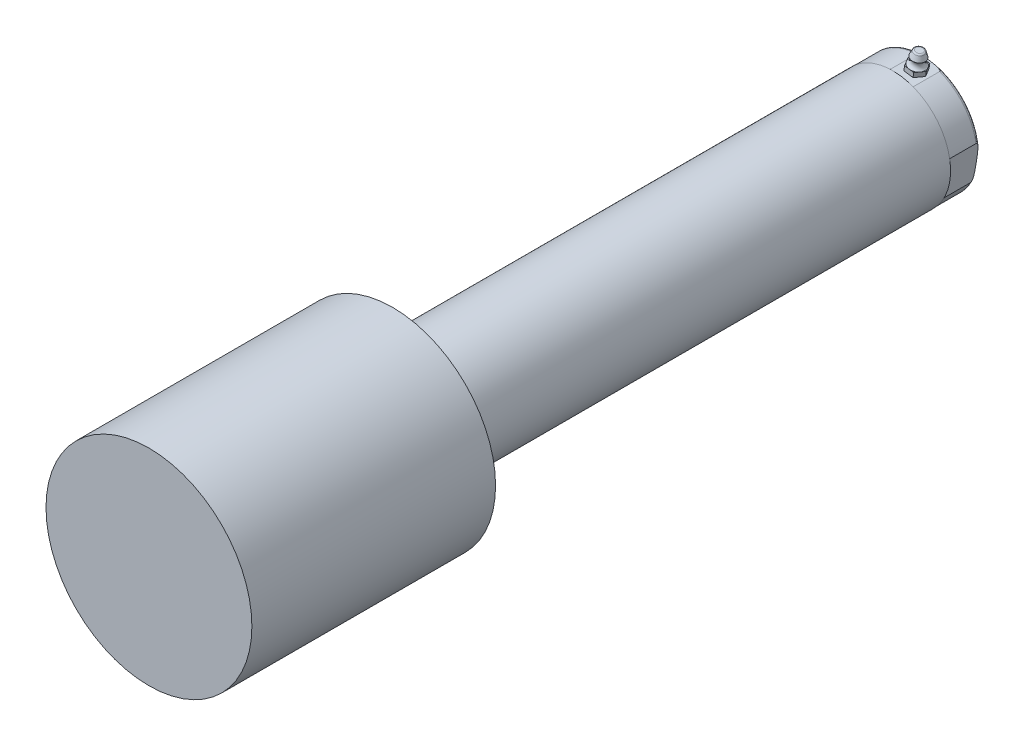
ISO-10303-21;
HEADER;
FILE_DESCRIPTION(('STEP AP214'),'2;1');
FILE_NAME('part.step','',(''),(''),'','','');
FILE_SCHEMA(('AUTOMOTIVE_DESIGN { 1 0 10303 214 1 1 1 1 }'));
ENDSEC;
DATA;
#1=APPLICATION_CONTEXT('core data for automotive mechanical design processes');
#2=APPLICATION_PROTOCOL_DEFINITION('international standard','automotive_design',2000,#1);
#3=PRODUCT_CONTEXT('',#1,'mechanical');
#4=PRODUCT('Part','Part','',(#3));
#5=PRODUCT_RELATED_PRODUCT_CATEGORY('part','',(#4));
#6=PRODUCT_DEFINITION_FORMATION('','',#4);
#7=PRODUCT_DEFINITION_CONTEXT('part definition',#1,'design');
#8=PRODUCT_DEFINITION('design','',#6,#7);
#9=PRODUCT_DEFINITION_SHAPE('','',#8);
#10=(LENGTH_UNIT() NAMED_UNIT(*) SI_UNIT(.MILLI.,.METRE.));
#11=(NAMED_UNIT(*) PLANE_ANGLE_UNIT() SI_UNIT($,.RADIAN.));
#12=(NAMED_UNIT(*) SI_UNIT($,.STERADIAN.) SOLID_ANGLE_UNIT());
#13=UNCERTAINTY_MEASURE_WITH_UNIT(LENGTH_MEASURE(1.E-05),#10,'distance_accuracy_value','');
#14=(GEOMETRIC_REPRESENTATION_CONTEXT(3) GLOBAL_UNCERTAINTY_ASSIGNED_CONTEXT((#13)) GLOBAL_UNIT_ASSIGNED_CONTEXT((#10,
#11,#12)) REPRESENTATION_CONTEXT('',''));
#15=CARTESIAN_POINT('',(0.,0.,0.));
#16=DIRECTION('',(0.,0.,1.));
#17=DIRECTION('',(1.,0.,0.));
#18=AXIS2_PLACEMENT_3D('',#15,#16,#17);
#19=CARTESIAN_POINT('',(6.99664169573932,29.5276526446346,-273.76755));
#20=DIRECTION('',(0.156434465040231,0.987688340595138,0.));
#21=DIRECTION('',(0.493844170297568,-0.0782172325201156,0.866025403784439));
#22=AXIS2_PLACEMENT_3D('',#19,#20,#21);
#23=PLANE('',#22);
#24=CARTESIAN_POINT('',(4.73349324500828,29.886100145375,-269.7988));
#25=DIRECTION('',(-0.156434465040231,-0.987688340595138,0.));
#26=DIRECTION('',(0.855363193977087,-0.135476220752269,-0.5));
#27=AXIS2_PLACEMENT_3D('',#24,#25,#26);
#28=CIRCLE('',#27,3.96875);
#29=CARTESIAN_POINT('',(1.33877056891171,30.4237713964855,-267.814425));
#30=VERTEX_POINT('',#29);
#31=CARTESIAN_POINT('',(1.33877056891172,30.4237713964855,-271.783175));
#32=VERTEX_POINT('',#31);
#33=EDGE_CURVE('E152',#30,#32,#28,.T.);
#34=ORIENTED_EDGE('',*,*,#33,.T.);
#35=DIRECTION('',(-0.493844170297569,0.0782172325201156,0.866025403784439));
#36=VECTOR('',#35,1.);
#37=CARTESIAN_POINT('',(2.47034479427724,30.2445476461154,-273.76755));
#38=LINE('',#37,#36);
#39=CARTESIAN_POINT('',(0.207196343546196,30.6029951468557,-269.7988));
#40=VERTEX_POINT('',#39);
#41=EDGE_CURVE('E166',#32,#40,#38,.T.);
#42=ORIENTED_EDGE('',*,*,#41,.T.);
#43=DIRECTION('',(0.493844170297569,-0.0782172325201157,0.866025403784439));
#44=VECTOR('',#43,1.);
#45=CARTESIAN_POINT('',(0.207196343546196,30.6029951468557,-269.7988));
#46=LINE('',#45,#44);
#47=EDGE_CURVE('E159',#40,#30,#46,.T.);
#48=ORIENTED_EDGE('',*,*,#47,.T.);
#49=EDGE_LOOP('',(#34,#42,#48));
#50=FACE_BOUND('',#49,.T.);
#51=ADVANCED_FACE('F17',(#50),#23,.T.);
#52=CARTESIAN_POINT('',(4.73349324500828,29.886100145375,-265.83005));
#53=VERTEX_POINT('',#52);
#54=EDGE_CURVE('E141',#53,#30,#28,.T.);
#55=ORIENTED_EDGE('',*,*,#54,.T.);
#56=CARTESIAN_POINT('',(2.47034479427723,30.2445476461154,-265.83005));
#57=VERTEX_POINT('',#56);
#58=EDGE_CURVE('E144',#30,#57,#46,.T.);
#59=ORIENTED_EDGE('',*,*,#58,.T.);
#60=DIRECTION('',(0.987688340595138,-0.156434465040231,0.));
#61=VECTOR('',#60,1.);
#62=CARTESIAN_POINT('',(2.47034479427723,30.2445476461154,-265.83005));
#63=LINE('',#62,#61);
#64=EDGE_CURVE('E147',#57,#53,#63,.T.);
#65=ORIENTED_EDGE('',*,*,#64,.T.);
#66=EDGE_LOOP('',(#55,#59,#65));
#67=FACE_BOUND('',#66,.T.);
#68=ADVANCED_FACE('F143',(#67),#23,.T.);
#69=CARTESIAN_POINT('',(8.12821592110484,29.3484288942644,-267.814425));
#70=VERTEX_POINT('',#69);
#71=EDGE_CURVE('E151',#70,#53,#28,.T.);
#72=ORIENTED_EDGE('',*,*,#71,.T.);
#73=CARTESIAN_POINT('',(6.99664169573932,29.5276526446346,-265.83005));
#74=VERTEX_POINT('',#73);
#75=EDGE_CURVE('E168',#53,#74,#63,.T.);
#76=ORIENTED_EDGE('',*,*,#75,.T.);
#77=DIRECTION('',(0.493844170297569,-0.0782172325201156,-0.866025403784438));
#78=VECTOR('',#77,1.);
#79=CARTESIAN_POINT('',(6.99664169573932,29.5276526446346,-265.83005));
#80=LINE('',#79,#78);
#81=EDGE_CURVE('E187',#74,#70,#80,.T.);
#82=ORIENTED_EDGE('',*,*,#81,.T.);
#83=EDGE_LOOP('',(#72,#76,#82));
#84=FACE_BOUND('',#83,.T.);
#85=ADVANCED_FACE('F315',(#84),#23,.T.);
#86=CARTESIAN_POINT('',(8.12821592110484,29.3484288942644,-271.783175));
#87=VERTEX_POINT('',#86);
#88=EDGE_CURVE('E37',#87,#70,#28,.T.);
#89=ORIENTED_EDGE('',*,*,#88,.T.);
#90=CARTESIAN_POINT('',(9.25979014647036,29.1692051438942,-269.7988));
#91=VERTEX_POINT('',#90);
#92=EDGE_CURVE('E186',#70,#91,#80,.T.);
#93=ORIENTED_EDGE('',*,*,#92,.T.);
#94=DIRECTION('',(-0.493844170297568,0.0782172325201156,-0.866025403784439));
#95=VECTOR('',#94,1.);
#96=CARTESIAN_POINT('',(9.25979014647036,29.1692051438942,-269.7988));
#97=LINE('',#96,#95);
#98=EDGE_CURVE('E177',#91,#87,#97,.T.);
#99=ORIENTED_EDGE('',*,*,#98,.T.);
#100=EDGE_LOOP('',(#89,#93,#99));
#101=FACE_BOUND('',#100,.T.);
#102=ADVANCED_FACE('F320',(#101),#23,.T.);
#103=CARTESIAN_POINT('',(4.73349324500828,29.886100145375,-273.76755));
#104=VERTEX_POINT('',#103);
#105=EDGE_CURVE('E172',#104,#87,#28,.T.);
#106=ORIENTED_EDGE('',*,*,#105,.T.);
#107=CARTESIAN_POINT('',(6.99664169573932,29.5276526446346,-273.76755));
#108=VERTEX_POINT('',#107);
#109=EDGE_CURVE('E180',#87,#108,#97,.T.);
#110=ORIENTED_EDGE('',*,*,#109,.T.);
#111=DIRECTION('',(-0.987688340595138,0.156434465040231,0.));
#112=VECTOR('',#111,1.);
#113=CARTESIAN_POINT('',(6.99664169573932,29.5276526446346,-273.76755));
#114=LINE('',#113,#112);
#115=EDGE_CURVE('E181',#108,#104,#114,.T.);
#116=ORIENTED_EDGE('',*,*,#115,.T.);
#117=EDGE_LOOP('',(#106,#110,#116));
#118=FACE_BOUND('',#117,.T.);
#119=ADVANCED_FACE('F270',(#118),#23,.T.);
#120=CARTESIAN_POINT('',(9.25979014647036,29.1692051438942,-269.7988));
#121=DIRECTION('',(-0.855363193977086,0.135476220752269,0.5));
#122=DIRECTION('',(-0.156434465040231,-0.987688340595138,0.));
#123=AXIS2_PLACEMENT_3D('',#120,#121,#122);
#124=PLANE('',#123);
#125=DIRECTION('',(-0.493844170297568,0.0782172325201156,-0.866025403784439));
#126=VECTOR('',#125,1.);
#127=CARTESIAN_POINT('',(8.88728057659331,26.8172722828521,-269.7988));
#128=LINE('',#127,#126);
#129=CARTESIAN_POINT('',(8.88728057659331,26.8172722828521,-269.7988));
#130=VERTEX_POINT('',#129);
#131=CARTESIAN_POINT('',(6.62413212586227,27.1757197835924,-273.76755));
#132=VERTEX_POINT('',#131);
#133=EDGE_CURVE('E175',#130,#132,#128,.T.);
#134=ORIENTED_EDGE('',*,*,#133,.T.);
#135=DIRECTION('',(-0.156434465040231,-0.987688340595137,0.));
#136=VECTOR('',#135,1.);
#137=CARTESIAN_POINT('',(6.99664169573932,29.5276526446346,-273.76755));
#138=LINE('',#137,#136);
#139=EDGE_CURVE('E214',#108,#132,#138,.T.);
#140=ORIENTED_EDGE('',*,*,#139,.F.);
#141=ORIENTED_EDGE('',*,*,#109,.F.);
#142=ORIENTED_EDGE('',*,*,#98,.F.);
#143=DIRECTION('',(-0.156434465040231,-0.987688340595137,0.));
#144=VECTOR('',#143,1.);
#145=CARTESIAN_POINT('',(9.25979014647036,29.1692051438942,-269.7988));
#146=LINE('',#145,#144);
#147=EDGE_CURVE('E190',#91,#130,#146,.T.);
#148=ORIENTED_EDGE('',*,*,#147,.T.);
#149=EDGE_LOOP('',(#134,#140,#141,#142,#148));
#150=FACE_BOUND('',#149,.T.);
#151=ADVANCED_FACE('F266',(#150),#124,.F.);
#152=CARTESIAN_POINT('',(6.99664169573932,29.5276526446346,-273.76755));
#153=DIRECTION('',(0.,0.,1.));
#154=DIRECTION('',(0.987688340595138,-0.156434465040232,0.));
#155=AXIS2_PLACEMENT_3D('',#152,#153,#154);
#156=PLANE('',#155);
#157=DIRECTION('',(-0.987688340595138,0.156434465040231,0.));
#158=VECTOR('',#157,1.);
#159=CARTESIAN_POINT('',(6.62413212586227,27.1757197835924,-273.76755));
#160=LINE('',#159,#158);
#161=CARTESIAN_POINT('',(2.09783522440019,27.8926147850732,-273.76755));
#162=VERTEX_POINT('',#161);
#163=EDGE_CURVE('E193',#132,#162,#160,.T.);
#164=ORIENTED_EDGE('',*,*,#163,.T.);
#165=DIRECTION('',(-0.156434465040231,-0.987688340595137,0.));
#166=VECTOR('',#165,1.);
#167=CARTESIAN_POINT('',(2.47034479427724,30.2445476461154,-273.76755));
#168=LINE('',#167,#166);
#169=CARTESIAN_POINT('',(2.47034479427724,30.2445476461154,-273.76755));
#170=VERTEX_POINT('',#169);
#171=EDGE_CURVE('E211',#170,#162,#168,.T.);
#172=ORIENTED_EDGE('',*,*,#171,.F.);
#173=EDGE_CURVE('E179',#104,#170,#114,.T.);
#174=ORIENTED_EDGE('',*,*,#173,.F.);
#175=ORIENTED_EDGE('',*,*,#115,.F.);
#176=ORIENTED_EDGE('',*,*,#139,.T.);
#177=EDGE_LOOP('',(#164,#172,#174,#175,#176));
#178=FACE_BOUND('',#177,.T.);
#179=ADVANCED_FACE('F269',(#178),#156,.F.);
#180=CARTESIAN_POINT('',(2.47034479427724,30.2445476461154,-273.76755));
#181=DIRECTION('',(0.855363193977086,-0.135476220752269,0.5));
#182=DIRECTION('',(0.493844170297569,-0.0782172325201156,-0.866025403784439));
#183=AXIS2_PLACEMENT_3D('',#180,#181,#182);
#184=PLANE('',#183);
#185=DIRECTION('',(-0.493844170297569,0.0782172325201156,0.866025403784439));
#186=VECTOR('',#185,1.);
#187=CARTESIAN_POINT('',(2.09783522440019,27.8926147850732,-273.76755));
#188=LINE('',#187,#186);
#189=CARTESIAN_POINT('',(-0.165313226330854,28.2510622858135,-269.7988));
#190=VERTEX_POINT('',#189);
#191=EDGE_CURVE('E195',#162,#190,#188,.T.);
#192=ORIENTED_EDGE('',*,*,#191,.T.);
#193=DIRECTION('',(-0.156434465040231,-0.987688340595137,0.));
#194=VECTOR('',#193,1.);
#195=CARTESIAN_POINT('',(0.207196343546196,30.6029951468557,-269.7988));
#196=LINE('',#195,#194);
#197=EDGE_CURVE('E209',#40,#190,#196,.T.);
#198=ORIENTED_EDGE('',*,*,#197,.F.);
#199=ORIENTED_EDGE('',*,*,#41,.F.);
#200=EDGE_CURVE('E97',#170,#32,#38,.T.);
#201=ORIENTED_EDGE('',*,*,#200,.F.);
#202=ORIENTED_EDGE('',*,*,#171,.T.);
#203=EDGE_LOOP('',(#192,#198,#199,#201,#202));
#204=FACE_BOUND('',#203,.T.);
#205=ADVANCED_FACE('F274',(#204),#184,.F.);
#206=CARTESIAN_POINT('',(0.207196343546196,30.6029951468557,-269.7988));
#207=DIRECTION('',(0.855363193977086,-0.135476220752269,-0.5));
#208=DIRECTION('',(-0.493844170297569,0.0782172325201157,-0.866025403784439));
#209=AXIS2_PLACEMENT_3D('',#206,#207,#208);
#210=PLANE('',#209);
#211=DIRECTION('',(0.493844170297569,-0.0782172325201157,0.866025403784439));
#212=VECTOR('',#211,1.);
#213=CARTESIAN_POINT('',(-0.165313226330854,28.2510622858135,-269.7988));
#214=LINE('',#213,#212);
#215=CARTESIAN_POINT('',(2.09783522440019,27.8926147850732,-265.83005));
#216=VERTEX_POINT('',#215);
#217=EDGE_CURVE('E197',#190,#216,#214,.T.);
#218=ORIENTED_EDGE('',*,*,#217,.T.);
#219=DIRECTION('',(-0.156434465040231,-0.987688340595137,0.));
#220=VECTOR('',#219,1.);
#221=CARTESIAN_POINT('',(2.47034479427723,30.2445476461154,-265.83005));
#222=LINE('',#221,#220);
#223=EDGE_CURVE('E161',#57,#216,#222,.T.);
#224=ORIENTED_EDGE('',*,*,#223,.F.);
#225=ORIENTED_EDGE('',*,*,#58,.F.);
#226=ORIENTED_EDGE('',*,*,#47,.F.);
#227=ORIENTED_EDGE('',*,*,#197,.T.);
#228=EDGE_LOOP('',(#218,#224,#225,#226,#227));
#229=FACE_BOUND('',#228,.T.);
#230=ADVANCED_FACE('F157',(#229),#210,.F.);
#231=CARTESIAN_POINT('',(2.47034479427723,30.2445476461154,-265.83005));
#232=DIRECTION('',(0.,0.,-1.));
#233=DIRECTION('',(-0.987688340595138,0.156434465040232,0.));
#234=AXIS2_PLACEMENT_3D('',#231,#232,#233);
#235=PLANE('',#234);
#236=DIRECTION('',(0.987688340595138,-0.156434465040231,0.));
#237=VECTOR('',#236,1.);
#238=CARTESIAN_POINT('',(2.09783522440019,27.8926147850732,-265.83005));
#239=LINE('',#238,#237);
#240=CARTESIAN_POINT('',(6.62413212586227,27.1757197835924,-265.83005));
#241=VERTEX_POINT('',#240);
#242=EDGE_CURVE('E199',#216,#241,#239,.T.);
#243=ORIENTED_EDGE('',*,*,#242,.T.);
#244=DIRECTION('',(-0.156434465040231,-0.987688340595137,0.));
#245=VECTOR('',#244,1.);
#246=CARTESIAN_POINT('',(6.99664169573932,29.5276526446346,-265.83005));
#247=LINE('',#246,#245);
#248=EDGE_CURVE('E205',#74,#241,#247,.T.);
#249=ORIENTED_EDGE('',*,*,#248,.F.);
#250=ORIENTED_EDGE('',*,*,#75,.F.);
#251=ORIENTED_EDGE('',*,*,#64,.F.);
#252=ORIENTED_EDGE('',*,*,#223,.T.);
#253=EDGE_LOOP('',(#243,#249,#250,#251,#252));
#254=FACE_BOUND('',#253,.T.);
#255=ADVANCED_FACE('F281',(#254),#235,.F.);
#256=CARTESIAN_POINT('',(6.99664169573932,29.5276526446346,-265.83005));
#257=DIRECTION('',(-0.855363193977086,0.135476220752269,-0.5));
#258=DIRECTION('',(-0.493844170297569,0.0782172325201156,0.866025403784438));
#259=AXIS2_PLACEMENT_3D('',#256,#257,#258);
#260=PLANE('',#259);
#261=DIRECTION('',(0.493844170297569,-0.0782172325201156,-0.866025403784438));
#262=VECTOR('',#261,1.);
#263=CARTESIAN_POINT('',(6.62413212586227,27.1757197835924,-265.83005));
#264=LINE('',#263,#262);
#265=EDGE_CURVE('E201',#241,#130,#264,.T.);
#266=ORIENTED_EDGE('',*,*,#265,.T.);
#267=ORIENTED_EDGE('',*,*,#147,.F.);
#268=ORIENTED_EDGE('',*,*,#92,.F.);
#269=ORIENTED_EDGE('',*,*,#81,.F.);
#270=ORIENTED_EDGE('',*,*,#248,.T.);
#271=EDGE_LOOP('',(#266,#267,#268,#269,#270));
#272=FACE_BOUND('',#271,.T.);
#273=ADVANCED_FACE('F284',(#272),#260,.F.);
#274=EDGE_CURVE('E171',#32,#104,#28,.T.);
#275=ORIENTED_EDGE('',*,*,#274,.T.);
#276=ORIENTED_EDGE('',*,*,#173,.T.);
#277=ORIENTED_EDGE('',*,*,#200,.T.);
#278=EDGE_LOOP('',(#275,#276,#277));
#279=FACE_BOUND('',#278,.T.);
#280=ADVANCED_FACE('F288',(#279),#23,.T.);
#281=CARTESIAN_POINT('',(5.31212477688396,33.5394358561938,-269.7988));
#282=DIRECTION('',(-0.156434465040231,-0.987688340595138,0.));
#283=DIRECTION('',(0.855363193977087,-0.135476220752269,-0.5));
#284=AXIS2_PLACEMENT_3D('',#281,#282,#283);
#285=CONICAL_SURFACE('',#284,3.3655,0.340381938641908);
#286=CARTESIAN_POINT('',(5.70952956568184,36.0485509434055,-269.7988));
#287=DIRECTION('',(0.156434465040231,0.987688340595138,0.));
#288=DIRECTION('',(-0.855363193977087,0.135476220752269,0.5));
#289=AXIS2_PLACEMENT_3D('',#286,#287,#288);
#290=CIRCLE('',#289,2.46577800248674);
#291=CARTESIAN_POINT('',(3.60039381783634,36.3826052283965,-268.565910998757));
#292=VERTEX_POINT('',#291);
#293=EDGE_CURVE('E217',#292,#292,#290,.F.);
#294=ORIENTED_EDGE('',*,*,#293,.T.);
#295=EDGE_LOOP('',(#294));
#296=FACE_BOUND('',#295,.T.);
#297=CARTESIAN_POINT('',(5.31212477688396,33.5394358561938,-269.7988));
#298=DIRECTION('',(-0.156434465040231,-0.987688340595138,0.));
#299=DIRECTION('',(0.855363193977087,-0.135476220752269,-0.5));
#300=AXIS2_PLACEMENT_3D('',#297,#298,#299);
#301=CIRCLE('',#300,3.3655);
#302=CARTESIAN_POINT('',(8.19084960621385,33.083490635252,-271.48155));
#303=VERTEX_POINT('',#302);
#304=EDGE_CURVE('E176',#303,#303,#301,.T.);
#305=ORIENTED_EDGE('',*,*,#304,.F.);
#306=EDGE_LOOP('',(#305));
#307=FACE_BOUND('',#306,.T.);
#308=ADVANCED_FACE('F292',(#296,#307),#285,.T.);
#309=CARTESIAN_POINT('',(5.78893702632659,36.5499099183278,-269.7988));
#310=DIRECTION('',(0.156434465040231,0.987688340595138,0.));
#311=DIRECTION('',(-0.855363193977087,0.135476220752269,0.5));
#312=AXIS2_PLACEMENT_3D('',#309,#310,#311);
#313=PLANE('',#312);
#314=CARTESIAN_POINT('',(5.78893702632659,36.5499099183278,-269.7988));
#315=DIRECTION('',(0.156434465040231,0.987688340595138,0.));
#316=DIRECTION('',(-0.855363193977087,0.135476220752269,0.5));
#317=AXIS2_PLACEMENT_3D('',#314,#315,#316);
#318=CIRCLE('',#317,1.7474960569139);
#319=CARTESIAN_POINT('',(4.29419321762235,36.786654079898,-268.925051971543));
#320=VERTEX_POINT('',#319);
#321=EDGE_CURVE('E28',#320,#320,#318,.T.);
#322=ORIENTED_EDGE('',*,*,#321,.T.);
#323=EDGE_LOOP('',(#322));
#324=FACE_BOUND('',#323,.T.);
#325=ADVANCED_FACE('F295',(#324),#313,.T.);
#326=CARTESIAN_POINT('',(5.06209404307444,31.9608039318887,-269.7988));
#327=DIRECTION('',(-0.156434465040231,-0.987688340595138,0.));
#328=DIRECTION('',(0.855363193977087,-0.135476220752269,-0.5));
#329=AXIS2_PLACEMENT_3D('',#326,#327,#328);
#330=TOROIDAL_SURFACE('',#329,5.20693450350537,2.43833450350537);
#331=ORIENTED_EDGE('',*,*,#304,.T.);
#332=EDGE_LOOP('',(#331));
#333=FACE_BOUND('',#332,.T.);
#334=ORIENTED_EDGE('',*,*,#88,.F.);
#335=ORIENTED_EDGE('',*,*,#105,.F.);
#336=ORIENTED_EDGE('',*,*,#274,.F.);
#337=ORIENTED_EDGE('',*,*,#33,.F.);
#338=ORIENTED_EDGE('',*,*,#54,.F.);
#339=ORIENTED_EDGE('',*,*,#71,.F.);
#340=EDGE_LOOP('',(#334,#335,#336,#337,#338,#339));
#341=FACE_BOUND('',#340,.T.);
#342=ADVANCED_FACE('F169',(#333,#341),#330,.F.);
#343=CARTESIAN_POINT('',(5.66973396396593,35.7972914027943,-269.7988));
#344=DIRECTION('',(0.156434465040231,0.987688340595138,0.));
#345=DIRECTION('',(-0.855363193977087,0.135476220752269,0.5));
#346=AXIS2_PLACEMENT_3D('',#343,#344,#345);
#347=TOROIDAL_SURFACE('',#346,1.7474960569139,0.762);
#348=ORIENTED_EDGE('',*,*,#321,.F.);
#349=EDGE_LOOP('',(#348));
#350=FACE_BOUND('',#349,.T.);
#351=ORIENTED_EDGE('',*,*,#293,.F.);
#352=EDGE_LOOP('',(#351));
#353=FACE_BOUND('',#352,.T.);
#354=ADVANCED_FACE('F259',(#350,#353),#347,.T.);
#355=CARTESIAN_POINT('',(0.,0.,-213.6648));
#356=DIRECTION('',(0.,0.,-1.));
#357=DIRECTION('',(-0.156434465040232,-0.987688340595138,0.));
#358=AXIS2_PLACEMENT_3D('',#355,#356,#357);
#359=PLANE('',#358);
#360=CARTESIAN_POINT('',(0.,0.,-213.6648));
#361=DIRECTION('',(0.,0.,-1.));
#362=DIRECTION('',(-0.156434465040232,-0.987688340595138,0.));
#363=AXIS2_PLACEMENT_3D('',#360,#361,#362);
#364=CIRCLE('',#363,14.8844);
#365=CARTESIAN_POINT('',(-2.32843315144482,-14.7011483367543,-213.6648));
#366=VERTEX_POINT('',#365);
#367=EDGE_CURVE('E222',#366,#366,#364,.F.);
#368=ORIENTED_EDGE('',*,*,#367,.F.);
#369=EDGE_LOOP('',(#368));
#370=FACE_BOUND('',#369,.T.);
#371=ADVANCED_FACE('F255',(#370),#359,.T.);
#372=CARTESIAN_POINT('',(0.,0.,104.5718));
#373=DIRECTION('',(0.,0.,1.));
#374=DIRECTION('',(1.,0.,0.));
#375=AXIS2_PLACEMENT_3D('',#372,#373,#374);
#376=PLANE('',#375);
#377=CARTESIAN_POINT('',(0.,0.,104.5718));
#378=DIRECTION('',(0.,0.,1.));
#379=DIRECTION('',(1.,0.,0.));
#380=AXIS2_PLACEMENT_3D('',#377,#378,#379);
#381=CIRCLE('',#380,50.8);
#382=CARTESIAN_POINT('',(50.8,0.,104.5718));
#383=VERTEX_POINT('',#382);
#384=EDGE_CURVE('E352',#383,#383,#381,.T.);
#385=ORIENTED_EDGE('',*,*,#384,.T.);
#386=EDGE_LOOP('',(#385));
#387=FACE_BOUND('',#386,.T.);
#388=ADVANCED_FACE('F258',(#387),#376,.T.);
#389=CARTESIAN_POINT('',(0.,0.,-279.857012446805));
#390=DIRECTION('',(0.,0.,-1.));
#391=DIRECTION('',(-0.156434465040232,-0.987688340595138,0.));
#392=AXIS2_PLACEMENT_3D('',#389,#390,#391);
#393=CYLINDRICAL_SURFACE('',#392,14.8844);
#394=ORIENTED_EDGE('',*,*,#367,.T.);
#395=EDGE_LOOP('',(#394));
#396=FACE_BOUND('',#395,.T.);
#397=CARTESIAN_POINT('',(0.,0.,-275.8948));
#398=DIRECTION('',(0.,0.,1.));
#399=DIRECTION('',(0.156434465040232,0.987688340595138,0.));
#400=AXIS2_PLACEMENT_3D('',#397,#398,#399);
#401=CIRCLE('',#400,14.8844);
#402=CARTESIAN_POINT('',(2.32843315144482,14.7011483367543,-275.8948));
#403=VERTEX_POINT('',#402);
#404=EDGE_CURVE('E338',#403,#403,#401,.F.);
#405=ORIENTED_EDGE('',*,*,#404,.T.);
#406=EDGE_LOOP('',(#405));
#407=FACE_BOUND('',#406,.T.);
#408=ADVANCED_FACE('F364',(#396,#407),#393,.F.);
#409=CARTESIAN_POINT('',(0.,0.,104.5718));
#410=DIRECTION('',(0.,0.,-1.));
#411=DIRECTION('',(-1.,0.,0.));
#412=AXIS2_PLACEMENT_3D('',#409,#410,#411);
#413=CYLINDRICAL_SURFACE('',#412,50.8);
#414=ORIENTED_EDGE('',*,*,#384,.F.);
#415=EDGE_LOOP('',(#414));
#416=FACE_BOUND('',#415,.T.);
#417=CARTESIAN_POINT('',(0.,0.,-15.6718));
#418=DIRECTION('',(0.,0.,-1.));
#419=DIRECTION('',(-1.,0.,0.));
#420=AXIS2_PLACEMENT_3D('',#417,#418,#419);
#421=CIRCLE('',#420,50.8);
#422=CARTESIAN_POINT('',(-50.8,0.,-15.6718));
#423=VERTEX_POINT('',#422);
#424=EDGE_CURVE('E350',#423,#423,#421,.T.);
#425=ORIENTED_EDGE('',*,*,#424,.F.);
#426=EDGE_LOOP('',(#425));
#427=FACE_BOUND('',#426,.T.);
#428=ADVANCED_FACE('F261',(#416,#427),#413,.T.);
#429=CARTESIAN_POINT('',(0.,0.,-275.8948));
#430=DIRECTION('',(0.,0.,-1.));
#431=DIRECTION('',(-0.156434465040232,-0.987688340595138,0.));
#432=AXIS2_PLACEMENT_3D('',#429,#430,#431);
#433=CONICAL_SURFACE('',#432,14.8844,0.785398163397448);
#434=CARTESIAN_POINT('',(0.,0.,-277.1648));
#435=DIRECTION('',(0.,0.,1.));
#436=DIRECTION('',(0.156434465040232,0.987688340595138,0.));
#437=AXIS2_PLACEMENT_3D('',#434,#435,#436);
#438=CIRCLE('',#437,16.1544);
#439=CARTESIAN_POINT('',(2.52710492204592,15.9555125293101,-277.1648));
#440=VERTEX_POINT('',#439);
#441=EDGE_CURVE('E335',#440,#440,#438,.T.);
#442=ORIENTED_EDGE('',*,*,#441,.F.);
#443=EDGE_LOOP('',(#442));
#444=FACE_BOUND('',#443,.T.);
#445=ORIENTED_EDGE('',*,*,#404,.F.);
#446=EDGE_LOOP('',(#445));
#447=FACE_BOUND('',#446,.T.);
#448=ADVANCED_FACE('F370',(#444,#447),#433,.F.);
#449=CARTESIAN_POINT('',(0.,0.,-15.6718));
#450=DIRECTION('',(0.,0.,-1.));
#451=DIRECTION('',(-1.,0.,0.));
#452=AXIS2_PLACEMENT_3D('',#449,#450,#451);
#453=PLANE('',#452);
#454=CARTESIAN_POINT('',(0.,0.,-15.6718));
#455=DIRECTION('',(0.,0.,-1.));
#456=DIRECTION('',(-1.,0.,0.));
#457=AXIS2_PLACEMENT_3D('',#454,#455,#456);
#458=CIRCLE('',#457,28.56738);
#459=CARTESIAN_POINT('',(-28.56738,0.,-15.6718));
#460=VERTEX_POINT('',#459);
#461=EDGE_CURVE('E347',#460,#460,#458,.T.);
#462=ORIENTED_EDGE('',*,*,#461,.F.);
#463=EDGE_LOOP('',(#462));
#464=FACE_BOUND('',#463,.T.);
#465=ORIENTED_EDGE('',*,*,#424,.T.);
#466=EDGE_LOOP('',(#465));
#467=FACE_BOUND('',#466,.T.);
#468=ADVANCED_FACE('F367',(#464,#467),#453,.T.);
#469=CARTESIAN_POINT('',(2.32843315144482,14.7011483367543,-277.1648));
#470=DIRECTION('',(0.,0.,1.));
#471=DIRECTION('',(0.156434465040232,0.987688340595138,0.));
#472=AXIS2_PLACEMENT_3D('',#469,#470,#471);
#473=PLANE('',#472);
#474=ORIENTED_EDGE('',*,*,#441,.T.);
#475=EDGE_LOOP('',(#474));
#476=FACE_BOUND('',#475,.T.);
#477=CARTESIAN_POINT('',(0.,0.,-277.1648));
#478=DIRECTION('',(0.,0.,1.));
#479=DIRECTION('',(0.156434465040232,0.987688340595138,0.));
#480=AXIS2_PLACEMENT_3D('',#477,#478,#479);
#481=CIRCLE('',#480,26.8732);
#482=CARTESIAN_POINT('',(4.20389466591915,26.5423463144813,-277.1648));
#483=VERTEX_POINT('',#482);
#484=EDGE_CURVE('E427',#483,#483,#481,.F.);
#485=ORIENTED_EDGE('',*,*,#484,.T.);
#486=EDGE_LOOP('',(#485));
#487=FACE_BOUND('',#486,.T.);
#488=ADVANCED_FACE('F265',(#476,#487),#473,.F.);
#489=CARTESIAN_POINT('',(0.,0.,-237.0328));
#490=DIRECTION('',(0.,0.,-1.));
#491=DIRECTION('',(-1.,0.,0.));
#492=AXIS2_PLACEMENT_3D('',#489,#490,#491);
#493=CYLINDRICAL_SURFACE('',#492,28.56738);
#494=CARTESIAN_POINT('',(0.,0.,-262.4328));
#495=DIRECTION('',(0.,0.,-1.));
#496=DIRECTION('',(-1.,0.,0.));
#497=AXIS2_PLACEMENT_3D('',#494,#495,#496);
#498=CIRCLE('',#497,28.56738);
#499=CARTESIAN_POINT('',(-28.56738,0.,-262.4328));
#500=VERTEX_POINT('',#499);
#501=EDGE_CURVE('E21',#500,#500,#498,.T.);
#502=ORIENTED_EDGE('',*,*,#501,.F.);
#503=EDGE_LOOP('',(#502));
#504=FACE_BOUND('',#503,.T.);
#505=ORIENTED_EDGE('',*,*,#461,.T.);
#506=EDGE_LOOP('',(#505));
#507=FACE_BOUND('',#506,.T.);
#508=ADVANCED_FACE('F19',(#504,#507),#493,.T.);
#509=CARTESIAN_POINT('',(0.,0.,-279.857012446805));
#510=DIRECTION('',(0.,0.,-1.));
#511=DIRECTION('',(-0.156434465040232,-0.987688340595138,0.));
#512=AXIS2_PLACEMENT_3D('',#509,#510,#511);
#513=CYLINDRICAL_SURFACE('',#512,28.4607);
#514=CARTESIAN_POINT('',(0.,0.,-262.4328));
#515=DIRECTION('',(0.,0.,-1.));
#516=DIRECTION('',(-0.156434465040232,-0.987688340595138,0.));
#517=AXIS2_PLACEMENT_3D('',#514,#515,#516);
#518=CIRCLE('',#517,28.4607);
#519=CARTESIAN_POINT('',(25.1493362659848,-13.3237505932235,-262.4328));
#520=VERTEX_POINT('',#519);
#521=CARTESIAN_POINT('',(-28.0357054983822,-4.90006751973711,-262.4328));
#522=VERTEX_POINT('',#521);
#523=EDGE_CURVE('E425',#520,#522,#518,.T.);
#524=ORIENTED_EDGE('',*,*,#523,.T.);
#525=DIRECTION('',(0.,0.,-1.));
#526=VECTOR('',#525,1.);
#527=CARTESIAN_POINT('',(-28.0357054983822,-4.90006751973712,-173.504189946));
#528=LINE('',#527,#526);
#529=CARTESIAN_POINT('',(-28.0357054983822,-4.90006751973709,-275.5773));
#530=VERTEX_POINT('',#529);
#531=EDGE_CURVE('E440',#522,#530,#528,.T.);
#532=ORIENTED_EDGE('',*,*,#531,.T.);
#533=CARTESIAN_POINT('',(0.,0.,-275.5773));
#534=DIRECTION('',(0.,0.,1.));
#535=DIRECTION('',(0.156434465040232,0.987688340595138,0.));
#536=AXIS2_PLACEMENT_3D('',#533,#534,#535);
#537=CIRCLE('',#536,28.4607);
#538=CARTESIAN_POINT('',(25.1493362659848,-13.3237505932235,-275.5773));
#539=VERTEX_POINT('',#538);
#540=EDGE_CURVE('E430',#530,#539,#537,.T.);
#541=ORIENTED_EDGE('',*,*,#540,.T.);
#542=DIRECTION('',(0.,0.,-1.));
#543=VECTOR('',#542,1.);
#544=CARTESIAN_POINT('',(25.1493362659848,-13.3237505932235,-173.504189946));
#545=LINE('',#544,#543);
#546=EDGE_CURVE('E421',#520,#539,#545,.T.);
#547=ORIENTED_EDGE('',*,*,#546,.F.);
#548=EDGE_LOOP('',(#524,#532,#541,#547));
#549=FACE_BOUND('',#548,.T.);
#550=ADVANCED_FACE('F363',(#549),#513,.T.);
#551=CARTESIAN_POINT('',(-25.1493362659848,13.3237505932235,-173.504189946));
#552=DIRECTION('',(0.987688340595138,-0.156434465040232,0.));
#553=DIRECTION('',(0.,0.,-1.));
#554=AXIS2_PLACEMENT_3D('',#551,#552,#553);
#555=PLANE('',#554);
#556=DIRECTION('',(0.156434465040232,0.987688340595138,0.));
#557=VECTOR('',#556,1.);
#558=CARTESIAN_POINT('',(-25.1493362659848,13.3237505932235,-262.4328));
#559=LINE('',#558,#557);
#560=CARTESIAN_POINT('',(-25.1493362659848,13.3237505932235,-262.4328));
#561=VERTEX_POINT('',#560);
#562=EDGE_CURVE('E444',#522,#561,#559,.T.);
#563=ORIENTED_EDGE('',*,*,#562,.T.);
#564=DIRECTION('',(0.,0.,-1.));
#565=VECTOR('',#564,1.);
#566=CARTESIAN_POINT('',(-25.1493362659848,13.3237505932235,-173.504189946));
#567=LINE('',#566,#565);
#568=CARTESIAN_POINT('',(-25.1493362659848,13.3237505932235,-275.5773));
#569=VERTEX_POINT('',#568);
#570=EDGE_CURVE('E449',#561,#569,#567,.T.);
#571=ORIENTED_EDGE('',*,*,#570,.T.);
#572=CARTESIAN_POINT('',(-26.5925208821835,4.2118415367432,-277.163986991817));
#573=CARTESIAN_POINT('',(-26.5511407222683,4.47310558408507,-277.163987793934));
#574=CARTESIAN_POINT('',(-26.5097605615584,4.73436963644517,-277.163876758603));
#575=CARTESIAN_POINT('',(-26.4270001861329,5.25689808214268,-277.163262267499));
#576=CARTESIAN_POINT('',(-26.3856199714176,5.51816247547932,-277.162758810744));
#577=CARTESIAN_POINT('',(-26.3028374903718,6.04083049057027,-277.160842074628));
#578=CARTESIAN_POINT('',(-26.2614352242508,6.30223411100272,-277.159428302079));
#579=CARTESIAN_POINT('',(-26.1786345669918,6.82501688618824,-277.154827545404));
#580=CARTESIAN_POINT('',(-26.1372361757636,7.08639604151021,-277.151640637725));
#581=CARTESIAN_POINT('',(-26.0544109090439,7.60933419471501,-277.142265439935));
#582=CARTESIAN_POINT('',(-26.0129840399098,7.8708931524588,-277.136074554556));
#583=CARTESIAN_POINT('',(-25.9301548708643,8.39385594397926,-277.119046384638));
#584=CARTESIAN_POINT('',(-25.8887525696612,8.65525978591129,-277.108209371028));
#585=CARTESIAN_POINT('',(-25.8059682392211,9.17793947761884,-277.079716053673));
#586=CARTESIAN_POINT('',(-25.764586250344,9.43921507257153,-277.062054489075));
#587=CARTESIAN_POINT('',(-25.702616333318,9.83047773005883,-277.028191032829));
#588=CARTESIAN_POINT('',(-25.6819792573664,9.96077509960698,-277.015676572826));
#589=CARTESIAN_POINT('',(-25.6407547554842,10.2210563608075,-276.98768542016));
#590=CARTESIAN_POINT('',(-25.6201673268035,10.3510402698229,-276.972208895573));
#591=CARTESIAN_POINT('',(-25.5789869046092,10.6110432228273,-276.937623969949));
#592=CARTESIAN_POINT('',(-25.5583941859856,10.7410605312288,-276.918502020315));
#593=CARTESIAN_POINT('',(-25.5173138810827,11.0004313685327,-276.875875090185));
#594=CARTESIAN_POINT('',(-25.4968263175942,11.1297847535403,-276.852369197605));
#595=CARTESIAN_POINT('',(-25.4560775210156,11.3870625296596,-276.800007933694));
#596=CARTESIAN_POINT('',(-25.4358158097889,11.5149899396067,-276.771167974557));
#597=CARTESIAN_POINT('',(-25.395563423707,11.7691335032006,-276.706677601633));
#598=CARTESIAN_POINT('',(-25.3755726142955,11.8953505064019,-276.671030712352));
#599=CARTESIAN_POINT('',(-25.3423813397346,12.104911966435,-276.603651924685));
#600=CARTESIAN_POINT('',(-25.3290619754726,12.1890071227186,-276.5743393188));
#601=CARTESIAN_POINT('',(-25.3026919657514,12.3555008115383,-276.5104842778));
#602=CARTESIAN_POINT('',(-25.2896421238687,12.4378942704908,-276.475928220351));
#603=CARTESIAN_POINT('',(-25.2620816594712,12.6119041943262,-276.394555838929));
#604=CARTESIAN_POINT('',(-25.2476439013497,12.703060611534,-276.346679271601));
#605=CARTESIAN_POINT('',(-25.2268703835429,12.8342194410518,-276.265894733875));
#606=CARTESIAN_POINT('',(-25.220103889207,12.8769414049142,-276.237527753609));
#607=CARTESIAN_POINT('',(-25.2069820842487,12.9597892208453,-276.177173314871));
#608=CARTESIAN_POINT('',(-25.2006262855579,12.9999181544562,-276.14519028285));
#609=CARTESIAN_POINT('',(-25.189777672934,13.0684135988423,-276.083990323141));
#610=CARTESIAN_POINT('',(-25.1851730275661,13.0974861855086,-276.055591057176));
#611=CARTESIAN_POINT('',(-25.1764812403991,13.1523639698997,-275.995610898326));
#612=CARTESIAN_POINT('',(-25.1723946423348,13.1781657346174,-275.964026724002));
#613=CARTESIAN_POINT('',(-25.1649138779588,13.2253974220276,-275.896962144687));
#614=CARTESIAN_POINT('',(-25.1615294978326,13.2467655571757,-275.861436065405));
#615=CARTESIAN_POINT('',(-25.1558454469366,13.2826532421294,-275.787002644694));
#616=CARTESIAN_POINT('',(-25.1535422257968,13.2971952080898,-275.748106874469));
#617=CARTESIAN_POINT('',(-25.1507964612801,13.3145312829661,-275.679403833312));
#618=CARTESIAN_POINT('',(-25.1500110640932,13.3194900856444,-275.650157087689));
#619=CARTESIAN_POINT('',(-25.1492341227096,13.3243955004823,-275.591234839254));
#620=CARTESIAN_POINT('',(-25.149242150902,13.32434481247,-275.56155957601));
#621=CARTESIAN_POINT('',(-25.1500507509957,13.3192395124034,-275.502706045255));
#622=CARTESIAN_POINT('',(-25.1508502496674,13.3141916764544,-275.473527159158));
#623=CARTESIAN_POINT('',(-25.153161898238,13.2995965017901,-275.416351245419));
#624=CARTESIAN_POINT('',(-25.1546746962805,13.2900450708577,-275.38835531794));
#625=CARTESIAN_POINT('',(-25.1590629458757,13.2623387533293,-275.322478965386));
#626=CARTESIAN_POINT('',(-25.1622441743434,13.2422532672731,-275.285436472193));
#627=CARTESIAN_POINT('',(-25.1694733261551,13.1966101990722,-275.214999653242));
#628=CARTESIAN_POINT('',(-25.1735234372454,13.1710388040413,-275.181614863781));
#629=CARTESIAN_POINT('',(-25.1854159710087,13.0959523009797,-275.094992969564));
#630=CARTESIAN_POINT('',(-25.1938599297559,13.0426392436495,-275.04517050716));
#631=CARTESIAN_POINT('',(-25.2117401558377,12.9297479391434,-274.953551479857));
#632=CARTESIAN_POINT('',(-25.2211791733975,12.8701523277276,-274.911778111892));
#633=CARTESIAN_POINT('',(-25.244610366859,12.7222135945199,-274.818676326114));
#634=CARTESIAN_POINT('',(-25.2588930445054,12.6320363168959,-274.770371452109));
#635=CARTESIAN_POINT('',(-25.2881101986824,12.4475664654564,-274.682472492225));
#636=CARTESIAN_POINT('',(-25.3030459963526,12.3532655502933,-274.642897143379));
#637=CARTESIAN_POINT('',(-25.3333785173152,12.1617535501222,-274.570230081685));
#638=CARTESIAN_POINT('',(-25.3487771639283,12.0645303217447,-274.537171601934));
#639=CARTESIAN_POINT('',(-25.3798067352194,11.8686173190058,-274.47637170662));
#640=CARTESIAN_POINT('',(-25.3954373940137,11.7699292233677,-274.448624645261));
#641=CARTESIAN_POINT('',(-25.4259827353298,11.5770735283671,-274.398837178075));
#642=CARTESIAN_POINT('',(-25.4408882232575,11.4829639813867,-274.376563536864));
#643=CARTESIAN_POINT('',(-25.4708073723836,11.2940619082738,-274.335194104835));
#644=CARTESIAN_POINT('',(-25.4858210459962,11.1992693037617,-274.316098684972));
#645=CARTESIAN_POINT('',(-25.530993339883,10.9140626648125,-274.26281432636));
#646=CARTESIAN_POINT('',(-25.5612681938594,10.7229147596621,-274.232650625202));
#647=CARTESIAN_POINT('',(-25.6220500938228,10.3391529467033,-274.180199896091));
#648=CARTESIAN_POINT('',(-25.6525575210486,10.1465366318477,-274.157931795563));
#649=CARTESIAN_POINT('',(-25.7136677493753,9.76070183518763,-274.119462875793));
#650=CARTESIAN_POINT('',(-25.7442705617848,9.56748328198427,-274.10326280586));
#651=CARTESIAN_POINT('',(-25.8055635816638,9.18049438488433,-274.075492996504));
#652=CARTESIAN_POINT('',(-25.8362538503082,8.98672365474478,-274.063928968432));
#653=CARTESIAN_POINT('',(-25.8976632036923,8.59900025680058,-274.044355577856));
#654=CARTESIAN_POINT('',(-25.9283822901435,8.40504757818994,-274.036346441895));
#655=CARTESIAN_POINT('',(-25.9897832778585,8.01737699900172,-274.023010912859));
#656=CARTESIAN_POINT('',(-26.020465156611,7.82365924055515,-274.017680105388));
#657=CARTESIAN_POINT('',(-26.0818345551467,7.43618810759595,-274.008975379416));
#658=CARTESIAN_POINT('',(-26.1125220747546,7.24243473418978,-274.005601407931));
#659=CARTESIAN_POINT('',(-26.2035177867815,6.66791041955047,-273.99760868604));
#660=CARTESIAN_POINT('',(-26.2638298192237,6.28711523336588,-273.994931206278));
#661=CARTESIAN_POINT('',(-26.3844566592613,5.52550733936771,-273.99167484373));
#662=CARTESIAN_POINT('',(-26.444771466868,5.14469463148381,-273.991096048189));
#663=CARTESIAN_POINT('',(-26.5655056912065,4.38240873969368,-273.990522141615));
#664=CARTESIAN_POINT('',(-26.6259251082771,4.00093555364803,-273.990528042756));
#665=CARTESIAN_POINT('',(-26.7467587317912,3.23802208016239,-273.991153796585));
#666=CARTESIAN_POINT('',(-26.807172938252,2.85658179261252,-273.991773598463));
#667=CARTESIAN_POINT('',(-26.9284032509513,2.0911637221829,-273.995215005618));
#668=CARTESIAN_POINT('',(-26.9892193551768,1.70718595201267,-273.998051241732));
#669=CARTESIAN_POINT('',(-27.0804456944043,1.13120551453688,-274.006437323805));
#670=CARTESIAN_POINT('',(-27.1108602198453,0.939175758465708,-274.009922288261));
#671=CARTESIAN_POINT('',(-27.1716819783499,0.555162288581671,-274.018865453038));
#672=CARTESIAN_POINT('',(-27.2020892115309,0.363178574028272,-274.024323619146));
#673=CARTESIAN_POINT('',(-27.2627897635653,-0.0200696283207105,-274.03788913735));
#674=CARTESIAN_POINT('',(-27.2930831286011,-0.211334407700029,-274.045987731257));
#675=CARTESIAN_POINT('',(-27.3536413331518,-0.593683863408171,-274.065697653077));
#676=CARTESIAN_POINT('',(-27.3839061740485,-0.784768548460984,-274.077308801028));
#677=CARTESIAN_POINT('',(-27.4443675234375,-1.16650648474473,-274.105109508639));
#678=CARTESIAN_POINT('',(-27.4745640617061,-1.3571599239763,-274.121296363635));
#679=CARTESIAN_POINT('',(-27.5348631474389,-1.73787336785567,-274.159621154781));
#680=CARTESIAN_POINT('',(-27.5649657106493,-1.92793347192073,-274.181758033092));
#681=CARTESIAN_POINT('',(-27.6103079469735,-2.21421308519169,-274.221110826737));
#682=CARTESIAN_POINT('',(-27.6256092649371,-2.31082180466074,-274.235430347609));
#683=CARTESIAN_POINT('',(-27.65615488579,-2.50367926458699,-274.26644658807));
#684=CARTESIAN_POINT('',(-27.6713991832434,-2.59992797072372,-274.283143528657));
#685=CARTESIAN_POINT('',(-27.7018617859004,-2.79226127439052,-274.319375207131));
#686=CARTESIAN_POINT('',(-27.7170798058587,-2.88834407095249,-274.338919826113));
#687=CARTESIAN_POINT('',(-27.7474015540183,-3.07978805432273,-274.381310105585));
#688=CARTESIAN_POINT('',(-27.7625053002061,-3.17514935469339,-274.404155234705));
#689=CARTESIAN_POINT('',(-27.7923173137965,-3.36337500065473,-274.453422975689));
#690=CARTESIAN_POINT('',(-27.807028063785,-3.45625502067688,-274.479783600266));
#691=CARTESIAN_POINT('',(-27.8362229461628,-3.64058425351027,-274.537197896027));
#692=CARTESIAN_POINT('',(-27.8507071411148,-3.7320338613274,-274.568250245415));
#693=CARTESIAN_POINT('',(-27.8792650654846,-3.91234149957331,-274.636083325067));
#694=CARTESIAN_POINT('',(-27.8933404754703,-4.0012101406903,-274.672834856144));
#695=CARTESIAN_POINT('',(-27.920943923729,-4.17549145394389,-274.753865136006));
#696=CARTESIAN_POINT('',(-27.9344728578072,-4.26090978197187,-274.798130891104));
#697=CARTESIAN_POINT('',(-27.9527688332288,-4.37642602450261,-274.867345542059));
#698=CARTESIAN_POINT('',(-27.9579339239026,-4.40903712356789,-274.888000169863));
#699=CARTESIAN_POINT('',(-27.968068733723,-4.47302579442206,-274.931237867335));
#700=CARTESIAN_POINT('',(-27.9730383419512,-4.50440266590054,-274.953822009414));
#701=CARTESIAN_POINT('',(-27.982697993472,-4.56539130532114,-275.001102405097));
#702=CARTESIAN_POINT('',(-27.9873890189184,-4.59500927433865,-275.025790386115));
#703=CARTESIAN_POINT('',(-27.9964176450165,-4.65201377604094,-275.07765726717));
#704=CARTESIAN_POINT('',(-28.0007555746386,-4.67940238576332,-275.104833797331));
#705=CARTESIAN_POINT('',(-28.0088673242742,-4.73061795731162,-275.161444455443));
#706=CARTESIAN_POINT('',(-28.0126509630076,-4.75450691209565,-275.190820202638));
#707=CARTESIAN_POINT('',(-28.0195847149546,-4.79828489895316,-275.252570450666));
#708=CARTESIAN_POINT('',(-28.0227344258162,-4.8181713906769,-275.284946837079));
#709=CARTESIAN_POINT('',(-28.0282000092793,-4.85267972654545,-275.353142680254));
#710=CARTESIAN_POINT('',(-28.0305029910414,-4.86722018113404,-275.389005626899));
#711=CARTESIAN_POINT('',(-28.0339233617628,-4.88881555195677,-275.462948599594));
#712=CARTESIAN_POINT('',(-28.0350442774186,-4.89589273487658,-275.501021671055));
#713=CARTESIAN_POINT('',(-28.035863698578,-4.90106635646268,-275.572036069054));
#714=CARTESIAN_POINT('',(-28.0357504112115,-4.90035108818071,-275.604890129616));
#715=CARTESIAN_POINT('',(-28.0345623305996,-4.89284984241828,-275.669889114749));
#716=CARTESIAN_POINT('',(-28.0334866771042,-4.88605843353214,-275.702033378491));
#717=CARTESIAN_POINT('',(-28.0302928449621,-4.86589337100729,-275.768896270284));
#718=CARTESIAN_POINT('',(-28.0280530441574,-4.85175182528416,-275.803372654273));
#719=CARTESIAN_POINT('',(-28.0227355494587,-4.81817848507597,-275.869555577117));
#720=CARTESIAN_POINT('',(-28.0196564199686,-4.79873762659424,-275.901257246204));
#721=CARTESIAN_POINT('',(-28.0108612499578,-4.74320710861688,-275.979924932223));
#722=CARTESIAN_POINT('',(-28.0046691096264,-4.7041114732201,-276.02468966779));
#723=CARTESIAN_POINT('',(-27.9913409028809,-4.61996048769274,-276.107992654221));
#724=CARTESIAN_POINT('',(-27.9842022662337,-4.5748889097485,-276.146513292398));
#725=CARTESIAN_POINT('',(-27.9690787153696,-4.47940256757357,-276.219705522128));
#726=CARTESIAN_POINT('',(-27.9610732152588,-4.42885782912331,-276.25420055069));
#727=CARTESIAN_POINT('',(-27.944640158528,-4.32510359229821,-276.318854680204));
#728=CARTESIAN_POINT('',(-27.9362121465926,-4.27189121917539,-276.349008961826));
#729=CARTESIAN_POINT('',(-27.9190507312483,-4.16353830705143,-276.405817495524));
#730=CARTESIAN_POINT('',(-27.9103166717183,-4.10839362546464,-276.432463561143));
#731=CARTESIAN_POINT('',(-27.8926478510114,-3.99683708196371,-276.482763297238));
#732=CARTESIAN_POINT('',(-27.8837131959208,-3.94042588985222,-276.506418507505));
#733=CARTESIAN_POINT('',(-27.8590505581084,-3.78471212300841,-276.56774292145));
#734=CARTESIAN_POINT('',(-27.843169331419,-3.68444200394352,-276.60289031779));
#735=CARTESIAN_POINT('',(-27.811117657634,-3.48207570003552,-276.667374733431));
#736=CARTESIAN_POINT('',(-27.7949470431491,-3.37997845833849,-276.696708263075));
#737=CARTESIAN_POINT('',(-27.7623859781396,-3.17439598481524,-276.750756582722));
#738=CARTESIAN_POINT('',(-27.7459951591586,-3.0709084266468,-276.77546221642));
#739=CARTESIAN_POINT('',(-27.7130821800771,-2.86310405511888,-276.821026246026));
#740=CARTESIAN_POINT('',(-27.6965599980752,-2.75878710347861,-276.841883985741));
#741=CARTESIAN_POINT('',(-27.6467092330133,-2.44404176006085,-276.89984194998));
#742=CARTESIAN_POINT('',(-27.6132429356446,-2.23274387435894,-276.932097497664));
#743=CARTESIAN_POINT('',(-27.5461751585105,-1.80929459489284,-276.987309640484));
#744=CARTESIAN_POINT('',(-27.5125738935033,-1.59714455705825,-277.01027753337));
#745=CARTESIAN_POINT('',(-27.4420830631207,-1.15208296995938,-277.051206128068));
#746=CARTESIAN_POINT('',(-27.4051840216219,-0.919111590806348,-277.068484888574));
#747=CARTESIAN_POINT('',(-27.3313281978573,-0.452804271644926,-277.097089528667));
#748=CARTESIAN_POINT('',(-27.2943714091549,-0.219468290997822,-277.108414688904));
#749=CARTESIAN_POINT('',(-27.2204058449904,0.247531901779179,-277.126803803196));
#750=CARTESIAN_POINT('',(-27.1833970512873,0.481196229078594,-277.133864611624));
#751=CARTESIAN_POINT('',(-27.1093683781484,0.948594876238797,-277.145025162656));
#752=CARTESIAN_POINT('',(-27.072348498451,1.1823291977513,-277.149124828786));
#753=CARTESIAN_POINT('',(-26.9984230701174,1.64907598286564,-277.155373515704));
#754=CARTESIAN_POINT('',(-26.9615175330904,1.88208837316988,-277.157528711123));
#755=CARTESIAN_POINT('',(-26.8877050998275,2.34812173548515,-277.160678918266));
#756=CARTESIAN_POINT('',(-26.8507982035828,2.58114270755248,-277.161673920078));
#757=CARTESIAN_POINT('',(-26.7769962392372,3.0471099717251,-277.163048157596));
#758=CARTESIAN_POINT('',(-26.7401011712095,3.28005626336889,-277.163427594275));
#759=CARTESIAN_POINT('',(-26.6663110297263,3.74594888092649,-277.163896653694));
#760=CARTESIAN_POINT('',(-26.6294159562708,3.97889520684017,-277.163986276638));
#761=CARTESIAN_POINT('',(-26.5925208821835,4.2118415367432,-277.163986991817));
#762=B_SPLINE_CURVE_WITH_KNOTS('',3,(#572,#573,#574,#575,#576,#577,#578,#579,#580,#581,#582,
#583,#584,#585,#586,#587,#588,#589,#590,#591,#592,#593,#594,#595,#596,#597,#598,#599,#600,#601,
#602,#603,#604,#605,#606,#607,#608,#609,#610,#611,#612,#613,#614,#615,#616,#617,#618,#619,#620,
#621,#622,#623,#624,#625,#626,#627,#628,#629,#630,#631,#632,#633,#634,#635,#636,#637,#638,#639,
#640,#641,#642,#643,#644,#645,#646,#647,#648,#649,#650,#651,#652,#653,#654,#655,#656,#657,#658,
#659,#660,#661,#662,#663,#664,#665,#666,#667,#668,#669,#670,#671,#672,#673,#674,#675,#676,#677,
#678,#679,#680,#681,#682,#683,#684,#685,#686,#687,#688,#689,#690,#691,#692,#693,#694,#695,#696,
#697,#698,#699,#700,#701,#702,#703,#704,#705,#706,#707,#708,#709,#710,#711,#712,#713,#714,#715,
#716,#717,#718,#719,#720,#721,#722,#723,#724,#725,#726,#727,#728,#729,#730,#731,#732,#733,#734,
#735,#736,#737,#738,#739,#740,#741,#742,#743,#744,#745,#746,#747,#748,#749,#750,#751,#752,#753,
#754,#755,#756,#757,#758,#759,#760,#761),.UNSPECIFIED.,.T.,.F.,(4,2,2,2,2,2,2,2,2,2,2,2,2,2,2,2,
2,2,2,2,2,2,2,2,2,2,2,2,2,2,2,2,2,2,2,2,2,2,2,2,2,2,2,2,2,2,2,2,2,2,2,2,2,2,2,2,2,2,2,2,2,2,2,2,
2,2,2,2,2,2,2,2,2,2,2,2,2,2,2,2,2,2,2,2,2,2,2,2,2,2,2,2,2,2,4),(0.,0.793562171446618,
1.58712632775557,2.3811207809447,3.17508100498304,3.9697283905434,4.76432944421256,
5.55954425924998,5.95705955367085,6.35455229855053,6.75355222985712,7.15263526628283,
7.55058271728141,7.94832467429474,8.21833039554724,8.48904998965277,8.80019597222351,
8.95523940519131,9.11009506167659,9.23260448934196,9.35524145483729,9.479487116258,
9.60332186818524,9.6919449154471,9.78052020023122,9.86897554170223,9.95751141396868,
10.0835606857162,10.2099311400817,10.4290574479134,10.6488061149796,10.9579271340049,
11.2677053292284,11.5790245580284,11.8900110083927,12.1835009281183,12.4770250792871,
13.064369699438,13.6531129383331,14.2419288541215,14.8314679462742,15.4210446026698,
16.0096463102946,16.5982320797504,17.7548652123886,18.9115464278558,20.0702300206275,
21.2288177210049,22.3951186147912,22.9784755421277,23.5618223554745,24.1432535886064,
24.7246550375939,25.3057135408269,25.8866688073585,26.1832123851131,26.4797835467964,
26.7774094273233,27.0749874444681,27.3678803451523,27.6606908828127,27.9520479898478,
28.2429063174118,28.3596918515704,28.4765427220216,28.592953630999,28.7092548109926,
28.8231484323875,28.9371141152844,29.052749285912,29.1680384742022,29.266027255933,
29.364103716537,29.4754838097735,29.5870556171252,29.7653114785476,29.9440617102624,
30.1289216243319,30.3139852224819,30.4994732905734,30.68486547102,31.0069036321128,
31.3291345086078,31.6519963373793,31.9749131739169,32.6236340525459,33.2715634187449,
33.9809750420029,34.6904723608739,35.4004924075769,36.110530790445,36.8183064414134,
37.526088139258,38.2336387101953,38.9411887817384),.UNSPECIFIED.);
#763=EDGE_CURVE('E456',#530,#569,#762,.T.);
#764=ORIENTED_EDGE('',*,*,#763,.F.);
#765=ORIENTED_EDGE('',*,*,#531,.F.);
#766=EDGE_LOOP('',(#563,#571,#764,#765));
#767=FACE_BOUND('',#766,.T.);
#768=ADVANCED_FACE('F407',(#767),#555,.F.);
#769=CARTESIAN_POINT('',(28.0357054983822,4.90006751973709,-173.504189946));
#770=DIRECTION('',(-0.987688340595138,0.156434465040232,0.));
#771=DIRECTION('',(0.,0.,1.));
#772=AXIS2_PLACEMENT_3D('',#769,#770,#771);
#773=PLANE('',#772);
#774=DIRECTION('',(-0.156434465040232,-0.987688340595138,0.));
#775=VECTOR('',#774,1.);
#776=CARTESIAN_POINT('',(28.0357054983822,4.90006751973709,-262.4328));
#777=LINE('',#776,#775);
#778=CARTESIAN_POINT('',(28.0357054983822,4.9000675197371,-262.4328));
#779=VERTEX_POINT('',#778);
#780=EDGE_CURVE('E419',#779,#520,#777,.T.);
#781=ORIENTED_EDGE('',*,*,#780,.T.);
#782=ORIENTED_EDGE('',*,*,#546,.T.);
#783=CARTESIAN_POINT('',(26.5925208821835,-4.2118415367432,-277.163986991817));
#784=CARTESIAN_POINT('',(26.5511407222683,-4.47310558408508,-277.163987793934));
#785=CARTESIAN_POINT('',(26.5097605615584,-4.73436963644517,-277.163876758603));
#786=CARTESIAN_POINT('',(26.4270001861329,-5.25689808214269,-277.163262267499));
#787=CARTESIAN_POINT('',(26.3856199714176,-5.51816247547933,-277.162758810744));
#788=CARTESIAN_POINT('',(26.3028374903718,-6.04083049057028,-277.160842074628));
#789=CARTESIAN_POINT('',(26.2614352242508,-6.30223411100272,-277.159428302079));
#790=CARTESIAN_POINT('',(26.1786345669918,-6.82501688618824,-277.154827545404));
#791=CARTESIAN_POINT('',(26.1372361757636,-7.08639604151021,-277.151640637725));
#792=CARTESIAN_POINT('',(26.0544109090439,-7.60933419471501,-277.142265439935));
#793=CARTESIAN_POINT('',(26.0129840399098,-7.87089315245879,-277.136074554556));
#794=CARTESIAN_POINT('',(25.9301548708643,-8.39385594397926,-277.119046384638));
#795=CARTESIAN_POINT('',(25.8887525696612,-8.65525978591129,-277.108209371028));
#796=CARTESIAN_POINT('',(25.8059682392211,-9.17793947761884,-277.079716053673));
#797=CARTESIAN_POINT('',(25.764586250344,-9.43921507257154,-277.062054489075));
#798=CARTESIAN_POINT('',(25.702616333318,-9.83047773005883,-277.028191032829));
#799=CARTESIAN_POINT('',(25.6819792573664,-9.96077509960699,-277.015676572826));
#800=CARTESIAN_POINT('',(25.6407547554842,-10.2210563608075,-276.98768542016));
#801=CARTESIAN_POINT('',(25.6201673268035,-10.3510402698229,-276.972208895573));
#802=CARTESIAN_POINT('',(25.5789869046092,-10.6110432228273,-276.937623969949));
#803=CARTESIAN_POINT('',(25.5583941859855,-10.7410605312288,-276.918502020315));
#804=CARTESIAN_POINT('',(25.5173138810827,-11.0004313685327,-276.875875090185));
#805=CARTESIAN_POINT('',(25.4968263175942,-11.1297847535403,-276.852369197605));
#806=CARTESIAN_POINT('',(25.4560775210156,-11.3870625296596,-276.800007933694));
#807=CARTESIAN_POINT('',(25.4358158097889,-11.5149899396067,-276.771167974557));
#808=CARTESIAN_POINT('',(25.395563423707,-11.7691335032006,-276.706677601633));
#809=CARTESIAN_POINT('',(25.3755726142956,-11.8953505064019,-276.671030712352));
#810=CARTESIAN_POINT('',(25.3423813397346,-12.104911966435,-276.603651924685));
#811=CARTESIAN_POINT('',(25.3290619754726,-12.1890071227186,-276.5743393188));
#812=CARTESIAN_POINT('',(25.3026919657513,-12.3555008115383,-276.5104842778));
#813=CARTESIAN_POINT('',(25.2896421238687,-12.4378942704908,-276.475928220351));
#814=CARTESIAN_POINT('',(25.2620816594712,-12.6119041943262,-276.394555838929));
#815=CARTESIAN_POINT('',(25.2476439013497,-12.703060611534,-276.346679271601));
#816=CARTESIAN_POINT('',(25.2268703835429,-12.8342194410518,-276.265894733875));
#817=CARTESIAN_POINT('',(25.220103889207,-12.8769414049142,-276.237527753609));
#818=CARTESIAN_POINT('',(25.2069820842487,-12.9597892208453,-276.177173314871));
#819=CARTESIAN_POINT('',(25.2006262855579,-12.9999181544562,-276.14519028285));
#820=CARTESIAN_POINT('',(25.189777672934,-13.0684135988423,-276.083990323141));
#821=CARTESIAN_POINT('',(25.1851730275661,-13.0974861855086,-276.055591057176));
#822=CARTESIAN_POINT('',(25.176481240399,-13.1523639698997,-275.995610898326));
#823=CARTESIAN_POINT('',(25.1723946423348,-13.1781657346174,-275.964026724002));
#824=CARTESIAN_POINT('',(25.1649138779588,-13.2253974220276,-275.896962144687));
#825=CARTESIAN_POINT('',(25.1615294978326,-13.2467655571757,-275.861436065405));
#826=CARTESIAN_POINT('',(25.1558454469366,-13.2826532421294,-275.787002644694));
#827=CARTESIAN_POINT('',(25.1535422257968,-13.2971952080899,-275.748106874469));
#828=CARTESIAN_POINT('',(25.1507964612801,-13.3145312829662,-275.679403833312));
#829=CARTESIAN_POINT('',(25.1500110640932,-13.3194900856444,-275.650157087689));
#830=CARTESIAN_POINT('',(25.1492341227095,-13.3243955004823,-275.591234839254));
#831=CARTESIAN_POINT('',(25.149242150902,-13.32434481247,-275.56155957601));
#832=CARTESIAN_POINT('',(25.1500507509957,-13.3192395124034,-275.502706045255));
#833=CARTESIAN_POINT('',(25.1508502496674,-13.3141916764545,-275.473527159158));
#834=CARTESIAN_POINT('',(25.153161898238,-13.2995965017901,-275.416351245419));
#835=CARTESIAN_POINT('',(25.1546746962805,-13.2900450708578,-275.38835531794));
#836=CARTESIAN_POINT('',(25.1590629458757,-13.2623387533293,-275.322478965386));
#837=CARTESIAN_POINT('',(25.1622441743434,-13.2422532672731,-275.285436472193));
#838=CARTESIAN_POINT('',(25.1694733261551,-13.1966101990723,-275.214999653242));
#839=CARTESIAN_POINT('',(25.1735234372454,-13.1710388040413,-275.181614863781));
#840=CARTESIAN_POINT('',(25.1854159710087,-13.0959523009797,-275.094992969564));
#841=CARTESIAN_POINT('',(25.1938599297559,-13.0426392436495,-275.04517050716));
#842=CARTESIAN_POINT('',(25.2117401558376,-12.9297479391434,-274.953551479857));
#843=CARTESIAN_POINT('',(25.2211791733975,-12.8701523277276,-274.911778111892));
#844=CARTESIAN_POINT('',(25.244610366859,-12.7222135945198,-274.818676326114));
#845=CARTESIAN_POINT('',(25.2588930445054,-12.6320363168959,-274.770371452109));
#846=CARTESIAN_POINT('',(25.2881101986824,-12.4475664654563,-274.682472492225));
#847=CARTESIAN_POINT('',(25.3030459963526,-12.3532655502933,-274.642897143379));
#848=CARTESIAN_POINT('',(25.3333785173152,-12.1617535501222,-274.570230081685));
#849=CARTESIAN_POINT('',(25.3487771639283,-12.0645303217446,-274.537171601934));
#850=CARTESIAN_POINT('',(25.3798067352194,-11.8686173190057,-274.47637170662));
#851=CARTESIAN_POINT('',(25.3954373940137,-11.7699292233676,-274.448624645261));
#852=CARTESIAN_POINT('',(25.4259827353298,-11.577073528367,-274.398837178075));
#853=CARTESIAN_POINT('',(25.4408882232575,-11.4829639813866,-274.376563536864));
#854=CARTESIAN_POINT('',(25.4708073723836,-11.2940619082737,-274.335194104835));
#855=CARTESIAN_POINT('',(25.4858210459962,-11.1992693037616,-274.316098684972));
#856=CARTESIAN_POINT('',(25.530993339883,-10.9140626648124,-274.26281432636));
#857=CARTESIAN_POINT('',(25.5612681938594,-10.722914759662,-274.232650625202));
#858=CARTESIAN_POINT('',(25.6220500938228,-10.3391529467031,-274.180199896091));
#859=CARTESIAN_POINT('',(25.6525575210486,-10.1465366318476,-274.157931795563));
#860=CARTESIAN_POINT('',(25.7136677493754,-9.76070183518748,-274.119462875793));
#861=CARTESIAN_POINT('',(25.7442705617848,-9.56748328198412,-274.10326280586));
#862=CARTESIAN_POINT('',(25.8055635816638,-9.18049438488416,-274.075492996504));
#863=CARTESIAN_POINT('',(25.8362538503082,-8.9867236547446,-274.063928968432));
#864=CARTESIAN_POINT('',(25.8976632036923,-8.59900025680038,-274.044355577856));
#865=CARTESIAN_POINT('',(25.9283822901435,-8.40504757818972,-274.036346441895));
#866=CARTESIAN_POINT('',(25.9897832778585,-8.01737699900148,-274.023010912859));
#867=CARTESIAN_POINT('',(26.020465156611,-7.8236592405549,-274.017680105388));
#868=CARTESIAN_POINT('',(26.0818345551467,-7.43618810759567,-274.008975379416));
#869=CARTESIAN_POINT('',(26.1125220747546,-7.24243473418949,-274.005601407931));
#870=CARTESIAN_POINT('',(26.2035177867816,-6.66791041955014,-273.99760868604));
#871=CARTESIAN_POINT('',(26.2638298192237,-6.28711523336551,-273.994931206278));
#872=CARTESIAN_POINT('',(26.3844566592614,-5.52550733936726,-273.99167484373));
#873=CARTESIAN_POINT('',(26.4447714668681,-5.14469463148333,-273.991096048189));
#874=CARTESIAN_POINT('',(26.5655056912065,-4.38240873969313,-273.990522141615));
#875=CARTESIAN_POINT('',(26.6259251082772,-4.00093555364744,-273.990528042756));
#876=CARTESIAN_POINT('',(26.7467587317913,-3.23802208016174,-273.991153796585));
#877=CARTESIAN_POINT('',(26.8071729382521,-2.85658179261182,-273.991773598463));
#878=CARTESIAN_POINT('',(26.9284032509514,-2.09116372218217,-273.995215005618));
#879=CARTESIAN_POINT('',(26.9892193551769,-1.70718595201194,-273.998051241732));
#880=CARTESIAN_POINT('',(27.0804456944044,-1.13120551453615,-274.006437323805));
#881=CARTESIAN_POINT('',(27.1108602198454,-0.939175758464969,-274.009922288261));
#882=CARTESIAN_POINT('',(27.17168197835,-0.555162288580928,-274.018865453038));
#883=CARTESIAN_POINT('',(27.202089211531,-0.363178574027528,-274.024323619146));
#884=CARTESIAN_POINT('',(27.2627897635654,0.0200696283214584,-274.03788913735));
#885=CARTESIAN_POINT('',(27.2930831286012,0.211334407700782,-274.045987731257));
#886=CARTESIAN_POINT('',(27.3536413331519,0.593683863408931,-274.065697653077));
#887=CARTESIAN_POINT('',(27.3839061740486,0.784768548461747,-274.077308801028));
#888=CARTESIAN_POINT('',(27.4443675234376,1.16650648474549,-274.105109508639));
#889=CARTESIAN_POINT('',(27.4745640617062,1.35715992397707,-274.121296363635));
#890=CARTESIAN_POINT('',(27.5348631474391,1.73787336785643,-274.159621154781));
#891=CARTESIAN_POINT('',(27.5649657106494,1.9279334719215,-274.181758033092));
#892=CARTESIAN_POINT('',(27.6103079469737,2.21421308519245,-274.221110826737));
#893=CARTESIAN_POINT('',(27.6256092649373,2.31082180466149,-274.235430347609));
#894=CARTESIAN_POINT('',(27.6561548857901,2.50367926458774,-274.26644658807));
#895=CARTESIAN_POINT('',(27.6713991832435,2.59992797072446,-274.283143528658));
#896=CARTESIAN_POINT('',(27.7018617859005,2.79226127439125,-274.319375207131));
#897=CARTESIAN_POINT('',(27.7170798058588,2.88834407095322,-274.338919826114));
#898=CARTESIAN_POINT('',(27.7474015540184,3.07978805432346,-274.381310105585));
#899=CARTESIAN_POINT('',(27.7625053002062,3.17514935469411,-274.404155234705));
#900=CARTESIAN_POINT('',(27.7923173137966,3.36337500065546,-274.453422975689));
#901=CARTESIAN_POINT('',(27.8070280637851,3.45625502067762,-274.479783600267));
#902=CARTESIAN_POINT('',(27.8362229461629,3.64058425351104,-274.537197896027));
#903=CARTESIAN_POINT('',(27.8507071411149,3.73203386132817,-274.568250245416));
#904=CARTESIAN_POINT('',(27.8792650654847,3.91234149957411,-274.636083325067));
#905=CARTESIAN_POINT('',(27.8933404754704,4.00121014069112,-274.672834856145));
#906=CARTESIAN_POINT('',(27.9209439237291,4.17549145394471,-274.753865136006));
#907=CARTESIAN_POINT('',(27.9344728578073,4.26090978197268,-274.798130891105));
#908=CARTESIAN_POINT('',(27.9527688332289,4.37642602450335,-274.867345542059));
#909=CARTESIAN_POINT('',(27.9579339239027,4.40903712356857,-274.888000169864));
#910=CARTESIAN_POINT('',(27.9680687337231,4.47302579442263,-274.931237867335));
#911=CARTESIAN_POINT('',(27.9730383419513,4.50440266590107,-274.953822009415));
#912=CARTESIAN_POINT('',(27.9826979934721,4.56539130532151,-275.001102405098));
#913=CARTESIAN_POINT('',(27.9873890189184,4.59500927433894,-275.025790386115));
#914=CARTESIAN_POINT('',(27.9964176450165,4.65201377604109,-275.07765726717));
#915=CARTESIAN_POINT('',(28.0007555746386,4.67940238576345,-275.104833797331));
#916=CARTESIAN_POINT('',(28.0088673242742,4.73061795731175,-275.161444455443));
#917=CARTESIAN_POINT('',(28.0126509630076,4.75450691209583,-275.190820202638));
#918=CARTESIAN_POINT('',(28.0195847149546,4.7982848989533,-275.252570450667));
#919=CARTESIAN_POINT('',(28.0227344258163,4.81817139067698,-275.284946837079));
#920=CARTESIAN_POINT('',(28.0282000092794,4.85267972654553,-275.353142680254));
#921=CARTESIAN_POINT('',(28.0305029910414,4.86722018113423,-275.389005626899));
#922=CARTESIAN_POINT('',(28.0339233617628,4.88881555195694,-275.462948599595));
#923=CARTESIAN_POINT('',(28.0350442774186,4.89589273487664,-275.501021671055));
#924=CARTESIAN_POINT('',(28.035863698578,4.90106635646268,-275.572036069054));
#925=CARTESIAN_POINT('',(28.0357504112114,4.90035108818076,-275.604890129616));
#926=CARTESIAN_POINT('',(28.0345623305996,4.89284984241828,-275.669889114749));
#927=CARTESIAN_POINT('',(28.0334866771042,4.88605843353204,-275.702033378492));
#928=CARTESIAN_POINT('',(28.0302928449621,4.8658933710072,-275.768896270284));
#929=CARTESIAN_POINT('',(28.0280530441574,4.85175182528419,-275.803372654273));
#930=CARTESIAN_POINT('',(28.0227355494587,4.81817848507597,-275.869555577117));
#931=CARTESIAN_POINT('',(28.0196564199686,4.79873762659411,-275.901257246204));
#932=CARTESIAN_POINT('',(28.0108612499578,4.74320710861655,-275.979924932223));
#933=CARTESIAN_POINT('',(28.0046691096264,4.70411147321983,-276.02468966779));
#934=CARTESIAN_POINT('',(27.9913409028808,4.61996048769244,-276.107992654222));
#935=CARTESIAN_POINT('',(27.9842022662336,4.57488890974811,-276.146513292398));
#936=CARTESIAN_POINT('',(27.9690787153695,4.47940256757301,-276.219705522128));
#937=CARTESIAN_POINT('',(27.9610732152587,4.42885782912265,-276.25420055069));
#938=CARTESIAN_POINT('',(27.9446401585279,4.3251035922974,-276.318854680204));
#939=CARTESIAN_POINT('',(27.9362121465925,4.27189121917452,-276.349008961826));
#940=CARTESIAN_POINT('',(27.9190507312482,4.16353830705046,-276.405817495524));
#941=CARTESIAN_POINT('',(27.9103166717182,4.10839362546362,-276.432463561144));
#942=CARTESIAN_POINT('',(27.8926478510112,3.99683708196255,-276.482763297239));
#943=CARTESIAN_POINT('',(27.8837131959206,3.94042588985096,-276.506418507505));
#944=CARTESIAN_POINT('',(27.8590505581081,3.7847121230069,-276.56774292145));
#945=CARTESIAN_POINT('',(27.8431693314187,3.68444200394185,-276.602890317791));
#946=CARTESIAN_POINT('',(27.8111176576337,3.48207570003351,-276.667374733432));
#947=CARTESIAN_POINT('',(27.7949470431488,3.37997845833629,-276.696708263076));
#948=CARTESIAN_POINT('',(27.7623859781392,3.17439598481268,-276.750756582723));
#949=CARTESIAN_POINT('',(27.7459951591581,3.07090842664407,-276.775462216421));
#950=CARTESIAN_POINT('',(27.7130821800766,2.8631040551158,-276.821026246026));
#951=CARTESIAN_POINT('',(27.6965599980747,2.75878710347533,-276.841883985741));
#952=CARTESIAN_POINT('',(27.6467092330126,2.44404176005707,-276.89984194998));
#953=CARTESIAN_POINT('',(27.6132429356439,2.23274387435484,-276.932097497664));
#954=CARTESIAN_POINT('',(27.5461751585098,1.80929459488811,-276.987309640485));
#955=CARTESIAN_POINT('',(27.5125738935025,1.59714455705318,-277.010277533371));
#956=CARTESIAN_POINT('',(27.4420830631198,1.15208296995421,-277.051206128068));
#957=CARTESIAN_POINT('',(27.4051840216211,0.919111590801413,-277.068484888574));
#958=CARTESIAN_POINT('',(27.3313281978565,0.452804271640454,-277.097089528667));
#959=CARTESIAN_POINT('',(27.2943714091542,0.219468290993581,-277.108414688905));
#960=CARTESIAN_POINT('',(27.2204058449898,-0.247531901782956,-277.126803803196));
#961=CARTESIAN_POINT('',(27.1833970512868,-0.481196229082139,-277.133864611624));
#962=CARTESIAN_POINT('',(27.1093683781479,-0.94859487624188,-277.145025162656));
#963=CARTESIAN_POINT('',(27.0723484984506,-1.18232919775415,-277.149124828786));
#964=CARTESIAN_POINT('',(26.998423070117,-1.64907598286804,-277.155373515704));
#965=CARTESIAN_POINT('',(26.96151753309,-1.88208837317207,-277.157528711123));
#966=CARTESIAN_POINT('',(26.8877050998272,-2.3481217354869,-277.160678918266));
#967=CARTESIAN_POINT('',(26.8507982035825,-2.58114270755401,-277.161673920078));
#968=CARTESIAN_POINT('',(26.776996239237,-3.0471099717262,-277.163048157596));
#969=CARTESIAN_POINT('',(26.7401011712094,-3.28005626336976,-277.163427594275));
#970=CARTESIAN_POINT('',(26.6663110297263,-3.74594888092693,-277.163896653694));
#971=CARTESIAN_POINT('',(26.6294159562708,-3.97889520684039,-277.163986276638));
#972=CARTESIAN_POINT('',(26.5925208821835,-4.2118415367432,-277.163986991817));
#973=B_SPLINE_CURVE_WITH_KNOTS('',3,(#783,#784,#785,#786,#787,#788,#789,#790,#791,#792,#793,
#794,#795,#796,#797,#798,#799,#800,#801,#802,#803,#804,#805,#806,#807,#808,#809,#810,#811,#812,
#813,#814,#815,#816,#817,#818,#819,#820,#821,#822,#823,#824,#825,#826,#827,#828,#829,#830,#831,
#832,#833,#834,#835,#836,#837,#838,#839,#840,#841,#842,#843,#844,#845,#846,#847,#848,#849,#850,
#851,#852,#853,#854,#855,#856,#857,#858,#859,#860,#861,#862,#863,#864,#865,#866,#867,#868,#869,
#870,#871,#872,#873,#874,#875,#876,#877,#878,#879,#880,#881,#882,#883,#884,#885,#886,#887,#888,
#889,#890,#891,#892,#893,#894,#895,#896,#897,#898,#899,#900,#901,#902,#903,#904,#905,#906,#907,
#908,#909,#910,#911,#912,#913,#914,#915,#916,#917,#918,#919,#920,#921,#922,#923,#924,#925,#926,
#927,#928,#929,#930,#931,#932,#933,#934,#935,#936,#937,#938,#939,#940,#941,#942,#943,#944,#945,
#946,#947,#948,#949,#950,#951,#952,#953,#954,#955,#956,#957,#958,#959,#960,#961,#962,#963,#964,
#965,#966,#967,#968,#969,#970,#971,#972),.UNSPECIFIED.,.T.,.F.,(4,2,2,2,2,2,2,2,2,2,2,2,2,2,2,2,
2,2,2,2,2,2,2,2,2,2,2,2,2,2,2,2,2,2,2,2,2,2,2,2,2,2,2,2,2,2,2,2,2,2,2,2,2,2,2,2,2,2,2,2,2,2,2,2,
2,2,2,2,2,2,2,2,2,2,2,2,2,2,2,2,2,2,2,2,2,2,2,2,2,2,2,2,2,2,4),(0.,0.793562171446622,
1.58712632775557,2.3811207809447,3.17508100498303,3.96972839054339,4.76432944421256,
5.55954425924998,5.95705955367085,6.35455229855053,6.75355222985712,7.15263526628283,
7.55058271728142,7.94832467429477,8.21833039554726,8.48904998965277,8.80019597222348,
8.95523940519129,9.1100950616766,9.23260448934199,9.35524145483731,9.47948711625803,
9.60332186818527,9.69194491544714,9.78052020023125,9.8689755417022,9.95751141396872,
10.0835606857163,10.2099311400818,10.4290574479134,10.6488061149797,10.957927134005,
11.2677053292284,11.5790245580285,11.8900110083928,12.1835009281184,12.4770250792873,
13.0643696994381,13.6531129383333,14.2419288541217,14.8314679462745,15.42104460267,
16.0096463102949,16.5982320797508,17.7548652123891,18.9115464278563,20.0702300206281,
21.2288177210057,22.395118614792,22.9784755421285,23.5618223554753,24.1432535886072,
24.7246550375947,25.3057135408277,25.8866688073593,26.1832123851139,26.4797835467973,
26.7774094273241,27.0749874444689,27.3678803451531,27.6606908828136,27.9520479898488,
28.2429063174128,28.3596918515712,28.4765427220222,28.5929536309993,28.7092548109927,
28.8231484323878,28.9371141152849,29.0527492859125,29.1680384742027,29.2660272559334,
29.3641037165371,29.4754838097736,29.5870556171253,29.765311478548,29.9440617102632,
30.1289216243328,30.313985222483,30.4994732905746,30.6848654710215,31.0069036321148,
31.3291345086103,31.6519963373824,31.9749131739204,32.6236340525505,33.2715634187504,
33.9809750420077,34.690472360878,35.4004924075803,36.1105307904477,36.8183064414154,
37.5260881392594,38.233638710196,38.9411887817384),.UNSPECIFIED.);
#974=CARTESIAN_POINT('',(28.0357054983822,4.90006751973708,-275.5773));
#975=VERTEX_POINT('',#974);
#976=EDGE_CURVE('E412',#975,#539,#973,.T.);
#977=ORIENTED_EDGE('',*,*,#976,.F.);
#978=DIRECTION('',(0.,0.,-1.));
#979=VECTOR('',#978,1.);
#980=CARTESIAN_POINT('',(28.0357054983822,4.90006751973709,-173.504189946));
#981=LINE('',#980,#979);
#982=EDGE_CURVE('E420',#779,#975,#981,.T.);
#983=ORIENTED_EDGE('',*,*,#982,.F.);
#984=EDGE_LOOP('',(#781,#782,#977,#983));
#985=FACE_BOUND('',#984,.T.);
#986=ADVANCED_FACE('F403',(#985),#773,.F.);
#987=CARTESIAN_POINT('',(-1.30105531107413,28.4309461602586,-262.4328));
#988=VERTEX_POINT('',#987);
#989=EDGE_CURVE('E428',#561,#988,#518,.T.);
#990=ORIENTED_EDGE('',*,*,#989,.T.);
#991=DIRECTION('',(0.,0.,-1.));
#992=VECTOR('',#991,1.);
#993=CARTESIAN_POINT('',(-1.30105531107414,28.4309461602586,-173.504189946));
#994=LINE('',#993,#992);
#995=CARTESIAN_POINT('',(-1.3010553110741,28.4309461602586,-275.5773));
#996=VERTEX_POINT('',#995);
#997=EDGE_CURVE('E228',#988,#996,#994,.T.);
#998=ORIENTED_EDGE('',*,*,#997,.T.);
#999=EDGE_CURVE('E82',#996,#569,#537,.T.);
#1000=ORIENTED_EDGE('',*,*,#999,.T.);
#1001=ORIENTED_EDGE('',*,*,#570,.F.);
#1002=EDGE_LOOP('',(#990,#998,#1000,#1001));
#1003=FACE_BOUND('',#1002,.T.);
#1004=ADVANCED_FACE('F396',(#1003),#513,.T.);
#1005=CARTESIAN_POINT('',(0.,0.,-275.5773));
#1006=DIRECTION('',(0.,0.,1.));
#1007=DIRECTION('',(0.156434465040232,0.987688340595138,0.));
#1008=AXIS2_PLACEMENT_3D('',#1005,#1006,#1007);
#1009=TOROIDAL_SURFACE('',#1008,26.8732,1.5875);
#1010=CARTESIAN_POINT('',(4.36098367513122,27.5341672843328,-276.806840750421));
#1011=CARTESIAN_POINT('',(4.62316716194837,27.4926414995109,-276.806844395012));
#1012=CARTESIAN_POINT('',(4.88535462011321,27.4511150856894,-276.803773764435));
#1013=CARTESIAN_POINT('',(5.40967293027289,27.3680712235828,-276.791156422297));
#1014=CARTESIAN_POINT('',(5.67180372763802,27.3265537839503,-276.781607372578));
#1015=CARTESIAN_POINT('',(6.19499537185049,27.2436883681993,-276.754995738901));
#1016=CARTESIAN_POINT('',(6.4560571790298,27.2023402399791,-276.737953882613));
#1017=CARTESIAN_POINT('',(6.8470138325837,27.1404187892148,-276.705170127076));
#1018=CARTESIAN_POINT('',(6.97720572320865,27.1197984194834,-276.693041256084));
#1019=CARTESIAN_POINT('',(7.23729952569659,27.0786036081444,-276.665952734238));
#1020=CARTESIAN_POINT('',(7.36720145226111,27.0580291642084,-276.650993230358));
#1021=CARTESIAN_POINT('',(7.62671796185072,27.0169257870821,-276.617678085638));
#1022=CARTESIAN_POINT('',(7.75633212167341,26.9963969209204,-276.599319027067));
#1023=CARTESIAN_POINT('',(8.01498144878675,26.9554308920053,-276.558432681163));
#1024=CARTESIAN_POINT('',(8.1440163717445,26.9349937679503,-276.535903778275));
#1025=CARTESIAN_POINT('',(8.40168151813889,26.8941836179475,-276.485427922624));
#1026=CARTESIAN_POINT('',(8.53030707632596,26.8738113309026,-276.457456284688));
#1027=CARTESIAN_POINT('',(8.78579926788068,26.8333453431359,-276.394422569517));
#1028=CARTESIAN_POINT('',(8.91266744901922,26.8132513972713,-276.359367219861));
#1029=CARTESIAN_POINT('',(9.10117412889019,26.7833948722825,-276.298880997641));
#1030=CARTESIAN_POINT('',(9.16400670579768,26.7734431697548,-276.277279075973));
#1031=CARTESIAN_POINT('',(9.2885600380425,26.7537158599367,-276.230722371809));
#1032=CARTESIAN_POINT('',(9.3502793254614,26.7439404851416,-276.20576348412));
#1033=CARTESIAN_POINT('',(9.4713539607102,26.7247641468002,-276.151734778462));
#1034=CARTESIAN_POINT('',(9.53072448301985,26.7153607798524,-276.122700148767));
#1035=CARTESIAN_POINT('',(9.64631231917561,26.6970534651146,-276.058865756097));
#1036=CARTESIAN_POINT('',(9.70253797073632,26.6881481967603,-276.024082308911));
#1037=CARTESIAN_POINT('',(9.78401067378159,26.6752441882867,-275.96437972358));
#1038=CARTESIAN_POINT('',(9.81140820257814,26.670904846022,-275.942496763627));
#1039=CARTESIAN_POINT('',(9.86363976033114,26.66263217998,-275.89571568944));
#1040=CARTESIAN_POINT('',(9.88847464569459,26.6586987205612,-275.870818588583));
#1041=CARTESIAN_POINT('',(9.92798711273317,26.6524405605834,-275.824443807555));
#1042=CARTESIAN_POINT('',(9.94361320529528,26.6499656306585,-275.803805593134));
#1043=CARTESIAN_POINT('',(9.97162366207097,26.6455292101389,-275.7603682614));
#1044=CARTESIAN_POINT('',(9.98401449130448,26.6435666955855,-275.737573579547));
#1045=CARTESIAN_POINT('',(10.0016591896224,26.6407720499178,-275.696073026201));
#1046=CARTESIAN_POINT('',(10.0079281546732,26.6397791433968,-275.677815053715));
#1047=CARTESIAN_POINT('',(10.017387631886,26.6382809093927,-275.640500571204));
#1048=CARTESIAN_POINT('',(10.020582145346,26.6377749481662,-275.621445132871));
#1049=CARTESIAN_POINT('',(10.023546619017,26.637305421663,-275.582969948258));
#1050=CARTESIAN_POINT('',(10.0233014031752,26.6373442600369,-275.56354896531));
#1051=CARTESIAN_POINT('',(10.0193805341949,26.6379652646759,-275.525063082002));
#1052=CARTESIAN_POINT('',(10.0157021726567,26.6385478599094,-275.505998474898));
#1053=CARTESIAN_POINT('',(10.0043464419,26.6403464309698,-275.465264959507));
#1054=CARTESIAN_POINT('',(9.99604978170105,26.641660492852,-275.443775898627));
#1055=CARTESIAN_POINT('',(9.97615114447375,26.6448121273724,-275.402437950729));
#1056=CARTESIAN_POINT('',(9.96454278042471,26.6466507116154,-275.382592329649));
#1057=CARTESIAN_POINT('',(9.93089298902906,26.6519803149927,-275.332679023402));
#1058=CARTESIAN_POINT('',(9.90687176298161,26.6557849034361,-275.30399740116));
#1059=CARTESIAN_POINT('',(9.85505159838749,26.6639924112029,-275.250418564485));
#1060=CARTESIAN_POINT('',(9.82724200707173,26.6683970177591,-275.225532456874));
#1061=CARTESIAN_POINT('',(9.75903928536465,26.6791992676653,-275.170519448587));
#1062=CARTESIAN_POINT('',(9.71767163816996,26.6857512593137,-275.141647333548));
#1063=CARTESIAN_POINT('',(9.63241780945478,26.6992541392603,-275.087945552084));
#1064=CARTESIAN_POINT('',(9.58852662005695,26.7062058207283,-275.063124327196));
#1065=CARTESIAN_POINT('',(9.49893694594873,26.7203954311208,-275.01648901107));
#1066=CARTESIAN_POINT('',(9.45323015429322,26.7276346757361,-274.994691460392));
#1067=CARTESIAN_POINT('',(9.36079226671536,26.7422753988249,-274.953621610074));
#1068=CARTESIAN_POINT('',(9.31406222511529,26.7496767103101,-274.934346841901));
#1069=CARTESIAN_POINT('',(9.18215449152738,26.7705688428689,-274.883202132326));
#1070=CARTESIAN_POINT('',(9.09612483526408,26.7841946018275,-274.853591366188));
#1071=CARTESIAN_POINT('',(8.92259226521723,26.8116794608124,-274.799128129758));
#1072=CARTESIAN_POINT('',(8.83508845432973,26.8255387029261,-274.774278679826));
#1073=CARTESIAN_POINT('',(8.65895904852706,26.8534348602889,-274.728237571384));
#1074=CARTESIAN_POINT('',(8.57033148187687,26.8674720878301,-274.707053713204));
#1075=CARTESIAN_POINT('',(8.39242544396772,26.8956496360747,-274.667679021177));
#1076=CARTESIAN_POINT('',(8.30314687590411,26.9097899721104,-274.649488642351));
#1077=CARTESIAN_POINT('',(8.03437126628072,26.9523598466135,-274.598553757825));
#1078=CARTESIAN_POINT('',(7.85419078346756,26.9808976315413,-274.569508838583));
#1079=CARTESIAN_POINT('',(7.49311942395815,27.0380857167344,-274.518593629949));
#1080=CARTESIAN_POINT('',(7.31222973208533,27.0667358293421,-274.49671432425));
#1081=CARTESIAN_POINT('',(6.95200920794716,27.1237891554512,-274.458706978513));
#1082=CARTESIAN_POINT('',(6.77268489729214,27.1521913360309,-274.442514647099));
#1083=CARTESIAN_POINT('',(6.4136970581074,27.2090494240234,-274.414505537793));
#1084=CARTESIAN_POINT('',(6.23403350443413,27.2375053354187,-274.402689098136));
#1085=CARTESIAN_POINT('',(5.8743871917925,27.2944677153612,-274.382748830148));
#1086=CARTESIAN_POINT('',(5.69440429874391,27.3229742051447,-274.37462752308));
#1087=CARTESIAN_POINT('',(5.33431969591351,27.3800060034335,-274.361647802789));
#1088=CARTESIAN_POINT('',(5.15421798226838,27.4085313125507,-274.356789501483));
#1089=CARTESIAN_POINT('',(4.7943800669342,27.4655240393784,-274.350089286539));
#1090=CARTESIAN_POINT('',(4.61464399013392,27.4939914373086,-274.348240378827));
#1091=CARTESIAN_POINT('',(4.255165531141,27.5509272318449,-274.34744223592));
#1092=CARTESIAN_POINT('',(4.07542314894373,27.5793956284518,-274.348493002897));
#1093=CARTESIAN_POINT('',(3.71604493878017,27.6363155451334,-274.353547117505));
#1094=CARTESIAN_POINT('',(3.53640909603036,27.6647670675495,-274.357549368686));
#1095=CARTESIAN_POINT('',(3.17723681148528,27.7216543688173,-274.368712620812));
#1096=CARTESIAN_POINT('',(2.99770036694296,27.750090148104,-274.3758735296));
#1097=CARTESIAN_POINT('',(2.63906365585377,27.8068926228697,-274.393722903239));
#1098=CARTESIAN_POINT('',(2.45996313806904,27.8352593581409,-274.404406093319));
#1099=CARTESIAN_POINT('',(2.10202192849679,27.891951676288,-274.429903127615));
#1100=CARTESIAN_POINT('',(1.92318127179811,27.9202772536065,-274.444717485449));
#1101=CARTESIAN_POINT('',(1.56586071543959,27.9768712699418,-274.479382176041));
#1102=CARTESIAN_POINT('',(1.38738108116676,28.0051396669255,-274.499235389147));
#1103=CARTESIAN_POINT('',(1.03126253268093,28.0615433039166,-274.545337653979));
#1104=CARTESIAN_POINT('',(0.853623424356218,28.0896785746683,-274.571585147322));
#1105=CARTESIAN_POINT('',(0.499365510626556,28.1457875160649,-274.632656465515));
#1106=CARTESIAN_POINT('',(0.322749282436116,28.1737607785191,-274.667496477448));
#1107=CARTESIAN_POINT('',(0.0601100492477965,28.2153587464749,-274.729041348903));
#1108=CARTESIAN_POINT('',(-0.0269762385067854,28.2291518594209,-274.751079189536));
#1109=CARTESIAN_POINT('',(-0.200079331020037,28.256568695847,-274.799074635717));
#1110=CARTESIAN_POINT('',(-0.286096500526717,28.2701924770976,-274.825030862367));
#1111=CARTESIAN_POINT('',(-0.437610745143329,28.2941899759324,-274.875761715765));
#1112=CARTESIAN_POINT('',(-0.503435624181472,28.3046156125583,-274.899526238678));
#1113=CARTESIAN_POINT('',(-0.633707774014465,28.3252486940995,-274.951120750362));
#1114=CARTESIAN_POINT('',(-0.698151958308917,28.3354556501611,-274.978958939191));
#1115=CARTESIAN_POINT('',(-0.824998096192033,28.3555461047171,-275.040279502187));
#1116=CARTESIAN_POINT('',(-0.887380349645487,28.3654264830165,-275.073803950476));
#1117=CARTESIAN_POINT('',(-1.007500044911,28.3844515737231,-275.148719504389));
#1118=CARTESIAN_POINT('',(-1.06525110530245,28.3935984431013,-275.190086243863));
#1119=CARTESIAN_POINT('',(-1.14234520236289,28.4058089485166,-275.259661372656));
#1120=CARTESIAN_POINT('',(-1.1657721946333,28.4095194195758,-275.283156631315));
#1121=CARTESIAN_POINT('',(-1.20895768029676,28.4163593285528,-275.333386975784));
#1122=CARTESIAN_POINT('',(-1.22872791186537,28.4194906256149,-275.360111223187));
#1123=CARTESIAN_POINT('',(-1.25610186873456,28.4238262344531,-275.406317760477));
#1124=CARTESIAN_POINT('',(-1.26547822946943,28.4253113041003,-275.424712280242));
#1125=CARTESIAN_POINT('',(-1.28130255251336,28.4278176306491,-275.462762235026));
#1126=CARTESIAN_POINT('',(-1.28775357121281,28.4288393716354,-275.48241632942));
#1127=CARTESIAN_POINT('',(-1.29710427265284,28.4303203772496,-275.522807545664));
#1128=CARTESIAN_POINT('',(-1.29996767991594,28.4307738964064,-275.543553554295));
#1129=CARTESIAN_POINT('',(-1.30162746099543,28.4310367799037,-275.585210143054));
#1130=CARTESIAN_POINT('',(-1.30042574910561,28.4308464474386,-275.606120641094));
#1131=CARTESIAN_POINT('',(-1.29452633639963,28.4299120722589,-275.644766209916));
#1132=CARTESIAN_POINT('',(-1.29027766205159,28.4292391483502,-275.662575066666));
#1133=CARTESIAN_POINT('',(-1.27920054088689,28.4274847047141,-275.69734311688));
#1134=CARTESIAN_POINT('',(-1.27237040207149,28.4264029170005,-275.714301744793));
#1135=CARTESIAN_POINT('',(-1.25204859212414,28.4231842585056,-275.756718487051));
#1136=CARTESIAN_POINT('',(-1.23699080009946,28.4207993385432,-275.781402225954));
#1137=CARTESIAN_POINT('',(-1.20334145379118,28.415469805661,-275.828157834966));
#1138=CARTESIAN_POINT('',(-1.18473913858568,28.4125234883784,-275.850221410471));
#1139=CARTESIAN_POINT('',(-1.12752647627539,28.4034618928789,-275.910771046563));
#1140=CARTESIAN_POINT('',(-1.08590139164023,28.3968691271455,-275.946296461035));
#1141=CARTESIAN_POINT('',(-0.998455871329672,28.3830191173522,-276.011472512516));
#1142=CARTESIAN_POINT('',(-0.952623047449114,28.3757599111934,-276.041104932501));
#1143=CARTESIAN_POINT('',(-0.828754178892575,28.3561410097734,-276.113531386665));
#1144=CARTESIAN_POINT('',(-0.748712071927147,28.3434635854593,-276.152770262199));
#1145=CARTESIAN_POINT('',(-0.585460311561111,28.3176070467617,-276.223926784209));
#1146=CARTESIAN_POINT('',(-0.50224334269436,28.3044267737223,-276.255826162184));
#1147=CARTESIAN_POINT('',(-0.333581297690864,28.2777133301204,-276.314455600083));
#1148=CARTESIAN_POINT('',(-0.24812684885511,28.2641786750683,-276.341157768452));
#1149=CARTESIAN_POINT('',(-0.0762082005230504,28.2369494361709,-276.390454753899));
#1150=CARTESIAN_POINT('',(0.0102546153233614,28.2232550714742,-276.413054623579));
#1151=CARTESIAN_POINT('',(0.18383813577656,28.1957621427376,-276.455008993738));
#1152=CARTESIAN_POINT('',(0.270958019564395,28.1819637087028,-276.474367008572));
#1153=CARTESIAN_POINT('',(0.445731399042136,28.1542823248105,-276.510448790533));
#1154=CARTESIAN_POINT('',(0.5333849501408,28.1403993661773,-276.527172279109));
#1155=CARTESIAN_POINT('',(0.796992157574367,28.0986480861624,-276.574066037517));
#1156=CARTESIAN_POINT('',(0.973517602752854,28.0706892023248,-276.600942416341));
#1157=CARTESIAN_POINT('',(1.32774421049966,28.0145852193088,-276.648248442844));
#1158=CARTESIAN_POINT('',(1.50544704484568,27.9864398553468,-276.668664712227));
#1159=CARTESIAN_POINT('',(1.86136316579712,27.9300682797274,-276.704374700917));
#1160=CARTESIAN_POINT('',(2.03957649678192,27.901842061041,-276.719667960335));
#1161=CARTESIAN_POINT('',(2.39629186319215,27.845343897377,-276.74606484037));
#1162=CARTESIAN_POINT('',(2.57479388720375,27.8170719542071,-276.757168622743));
#1163=CARTESIAN_POINT('',(2.9319871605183,27.7604980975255,-276.77580919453));
#1164=CARTESIAN_POINT('',(3.11067842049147,27.7321961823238,-276.783345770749));
#1165=CARTESIAN_POINT('',(3.46794874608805,27.6756101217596,-276.795245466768));
#1166=CARTESIAN_POINT('',(3.6465276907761,27.6473259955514,-276.799612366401));
#1167=CARTESIAN_POINT('',(4.00373170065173,27.5907504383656,-276.805408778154));
#1168=CARTESIAN_POINT('',(4.18235676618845,27.5624590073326,-276.806838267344));
#1169=CARTESIAN_POINT('',(4.36098367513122,27.5341672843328,-276.806840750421));
#1170=B_SPLINE_CURVE_WITH_KNOTS('',3,(#1010,#1011,#1012,#1013,#1014,#1015,#1016,#1017,#1018,
#1019,#1020,#1021,#1022,#1023,#1024,#1025,#1026,#1027,#1028,#1029,#1030,#1031,#1032,#1033,#1034,
#1035,#1036,#1037,#1038,#1039,#1040,#1041,#1042,#1043,#1044,#1045,#1046,#1047,#1048,#1049,#1050,
#1051,#1052,#1053,#1054,#1055,#1056,#1057,#1058,#1059,#1060,#1061,#1062,#1063,#1064,#1065,#1066,
#1067,#1068,#1069,#1070,#1071,#1072,#1073,#1074,#1075,#1076,#1077,#1078,#1079,#1080,#1081,#1082,
#1083,#1084,#1085,#1086,#1087,#1088,#1089,#1090,#1091,#1092,#1093,#1094,#1095,#1096,#1097,#1098,
#1099,#1100,#1101,#1102,#1103,#1104,#1105,#1106,#1107,#1108,#1109,#1110,#1111,#1112,#1113,#1114,
#1115,#1116,#1117,#1118,#1119,#1120,#1121,#1122,#1123,#1124,#1125,#1126,#1127,#1128,#1129,#1130,
#1131,#1132,#1133,#1134,#1135,#1136,#1137,#1138,#1139,#1140,#1141,#1142,#1143,#1144,#1145,#1146,
#1147,#1148,#1149,#1150,#1151,#1152,#1153,#1154,#1155,#1156,#1157,#1158,#1159,#1160,#1161,#1162,
#1163,#1164,#1165,#1166,#1167,#1168,#1169),.UNSPECIFIED.,.T.,.F.,(4,2,2,2,2,2,2,2,2,2,2,2,2,2,2,
2,2,2,2,2,2,2,2,2,2,2,2,2,2,2,2,2,2,2,2,2,2,2,2,2,2,2,2,2,2,2,2,2,2,2,2,2,2,2,2,2,2,2,2,2,2,2,2,
2,2,2,2,2,2,2,2,2,2,2,2,2,2,2,2,4),(0.,0.796341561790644,1.59297068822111,2.38740979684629,
2.78450105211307,3.18157169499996,3.57904372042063,3.97667006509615,4.37614372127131,
4.77523975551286,4.97672550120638,5.17845992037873,5.37854902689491,5.57807971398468,
5.68392945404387,5.78974370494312,5.86754736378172,5.94519433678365,6.00295588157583,
6.06064214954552,6.11858300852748,6.17656961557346,6.2454020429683,6.31436813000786,
6.42654493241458,6.53904394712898,6.69128933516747,6.84384804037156,6.99721089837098,
7.15042255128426,7.42619901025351,7.70214983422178,7.9786808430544,8.25525384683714,
8.80920045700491,9.36244734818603,9.90922160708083,10.4560381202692,11.003227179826,
11.5504350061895,12.0963692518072,12.6423039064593,13.1880358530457,13.7337518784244,
14.2786543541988,14.8236246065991,15.3689070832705,15.9140567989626,16.4602414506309,
16.7328314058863,17.0053256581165,17.2175058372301,17.4301191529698,17.6443803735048,
17.8579864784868,17.9579154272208,18.0575178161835,18.1194185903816,18.1812545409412,
18.2437108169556,18.3061376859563,18.3608722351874,18.4156427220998,18.5021761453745,
18.5889765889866,18.7534080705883,18.9183402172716,19.187762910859,19.457849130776,
19.7293470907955,20.0005083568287,20.2713737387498,20.5422677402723,21.0842883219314,
21.6274241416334,22.170608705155,22.7137722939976,23.2569683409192,23.7995155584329,
24.342067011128),.UNSPECIFIED.);
#1171=CARTESIAN_POINT('',(10.0230226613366,26.6373884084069,-275.5773));
#1172=VERTEX_POINT('',#1171);
#1173=EDGE_CURVE('E230',#996,#1172,#1170,.T.);
#1174=ORIENTED_EDGE('',*,*,#1173,.T.);
#1175=EDGE_CURVE('E343',#975,#1172,#537,.T.);
#1176=ORIENTED_EDGE('',*,*,#1175,.F.);
#1177=ORIENTED_EDGE('',*,*,#976,.T.);
#1178=ORIENTED_EDGE('',*,*,#540,.F.);
#1179=ORIENTED_EDGE('',*,*,#763,.T.);
#1180=ORIENTED_EDGE('',*,*,#999,.F.);
#1181=EDGE_LOOP('',(#1174,#1176,#1177,#1178,#1179,#1180));
#1182=FACE_BOUND('',#1181,.T.);
#1183=ORIENTED_EDGE('',*,*,#484,.F.);
#1184=EDGE_LOOP('',(#1183));
#1185=FACE_BOUND('',#1184,.T.);
#1186=ADVANCED_FACE('F393',(#1182,#1185),#1009,.T.);
#1187=ORIENTED_EDGE('',*,*,#1175,.T.);
#1188=DIRECTION('',(0.,0.,-1.));
#1189=VECTOR('',#1188,1.);
#1190=CARTESIAN_POINT('',(10.0230226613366,26.6373884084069,-173.504189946));
#1191=LINE('',#1190,#1189);
#1192=CARTESIAN_POINT('',(10.0230226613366,26.6373884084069,-262.4328));
#1193=VERTEX_POINT('',#1192);
#1194=EDGE_CURVE('E88',#1193,#1172,#1191,.T.);
#1195=ORIENTED_EDGE('',*,*,#1194,.F.);
#1196=EDGE_CURVE('E424',#1193,#779,#518,.T.);
#1197=ORIENTED_EDGE('',*,*,#1196,.T.);
#1198=ORIENTED_EDGE('',*,*,#982,.T.);
#1199=EDGE_LOOP('',(#1187,#1195,#1197,#1198));
#1200=FACE_BOUND('',#1199,.T.);
#1201=ADVANCED_FACE('F384',(#1200),#513,.T.);
#1202=CARTESIAN_POINT('',(0.,0.,-262.4328));
#1203=DIRECTION('',(0.,0.,-1.));
#1204=DIRECTION('',(-1.,0.,0.));
#1205=AXIS2_PLACEMENT_3D('',#1202,#1203,#1204);
#1206=PLANE('',#1205);
#1207=ORIENTED_EDGE('',*,*,#780,.F.);
#1208=ORIENTED_EDGE('',*,*,#1196,.F.);
#1209=DIRECTION('',(0.987688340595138,-0.156434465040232,0.));
#1210=VECTOR('',#1209,1.);
#1211=CARTESIAN_POINT('',(10.0230226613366,26.6373884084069,-262.4328));
#1212=LINE('',#1211,#1210);
#1213=EDGE_CURVE('E238',#988,#1193,#1212,.T.);
#1214=ORIENTED_EDGE('',*,*,#1213,.F.);
#1215=ORIENTED_EDGE('',*,*,#989,.F.);
#1216=ORIENTED_EDGE('',*,*,#562,.F.);
#1217=ORIENTED_EDGE('',*,*,#523,.F.);
#1218=EDGE_LOOP('',(#1207,#1208,#1214,#1215,#1216,#1217));
#1219=FACE_BOUND('',#1218,.T.);
#1220=ORIENTED_EDGE('',*,*,#501,.T.);
#1221=EDGE_LOOP('',(#1220));
#1222=FACE_BOUND('',#1221,.T.);
#1223=ADVANCED_FACE('F359',(#1219,#1222),#1206,.T.);
#1224=CARTESIAN_POINT('',(10.0230226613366,26.6373884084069,-173.504189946));
#1225=DIRECTION('',(-0.156434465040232,-0.987688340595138,0.));
#1226=DIRECTION('',(0.,0.,1.));
#1227=AXIS2_PLACEMENT_3D('',#1224,#1225,#1226);
#1228=PLANE('',#1227);
#1229=ORIENTED_EDGE('',*,*,#133,.F.);
#1230=ORIENTED_EDGE('',*,*,#265,.F.);
#1231=ORIENTED_EDGE('',*,*,#242,.F.);
#1232=ORIENTED_EDGE('',*,*,#217,.F.);
#1233=ORIENTED_EDGE('',*,*,#191,.F.);
#1234=ORIENTED_EDGE('',*,*,#163,.F.);
#1235=EDGE_LOOP('',(#1229,#1230,#1231,#1232,#1233,#1234));
#1236=FACE_BOUND('',#1235,.T.);
#1237=ORIENTED_EDGE('',*,*,#1213,.T.);
#1238=ORIENTED_EDGE('',*,*,#1194,.T.);
#1239=ORIENTED_EDGE('',*,*,#1173,.F.);
#1240=ORIENTED_EDGE('',*,*,#997,.F.);
#1241=EDGE_LOOP('',(#1237,#1238,#1239,#1240));
#1242=FACE_BOUND('',#1241,.T.);
#1243=ADVANCED_FACE('F240',(#1236,#1242),#1228,.F.);
#1244=CLOSED_SHELL('',(#51,#68,#85,#102,#119,#151,#179,#205,#230,#255,#273,#280,#308,#325,#342,
#354,#371,#388,#408,#428,#448,#468,#488,#508,#550,#768,#986,#1004,#1186,#1201,#1223,#1243));
#1245=CARTESIAN_POINT('',(3.16895305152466,20.0079821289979,-269.7988));
#1246=DIRECTION('',(0.156434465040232,0.987688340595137,0.));
#1247=DIRECTION('',(0.,0.,-1.));
#1248=AXIS2_PLACEMENT_3D('',#1245,#1246,#1247);
#1249=CYLINDRICAL_SURFACE('',#1248,2.7051);
#1250=CARTESIAN_POINT('',(3.61596453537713,22.8303015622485,-269.7988));
#1251=DIRECTION('',(-0.156434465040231,-0.987688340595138,0.));
#1252=DIRECTION('',(0.987688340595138,-0.156434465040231,0.));
#1253=AXIS2_PLACEMENT_3D('',#1250,#1251,#1252);
#1254=CIRCLE('',#1253,2.7051);
#1255=CARTESIAN_POINT('',(6.28776026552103,22.4071306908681,-269.7988));
#1256=VERTEX_POINT('',#1255);
#1257=EDGE_CURVE('E10',#1256,#1256,#1254,.T.);
#1258=ORIENTED_EDGE('',*,*,#1257,.F.);
#1259=EDGE_LOOP('',(#1258));
#1260=FACE_BOUND('',#1259,.T.);
#1261=CARTESIAN_POINT('',(3.16895305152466,20.0079821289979,-269.7988));
#1262=DIRECTION('',(0.156434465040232,0.987688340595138,0.));
#1263=DIRECTION('',(0.,0.,-1.));
#1264=AXIS2_PLACEMENT_3D('',#1261,#1262,#1263);
#1265=CIRCLE('',#1264,2.7051);
#1266=CARTESIAN_POINT('',(3.16895305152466,20.0079821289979,-272.5039));
#1267=VERTEX_POINT('',#1266);
#1268=EDGE_CURVE('E225',#1267,#1267,#1265,.T.);
#1269=ORIENTED_EDGE('',*,*,#1268,.F.);
#1270=EDGE_LOOP('',(#1269));
#1271=FACE_BOUND('',#1270,.T.);
#1272=ADVANCED_FACE('F245',(#1260,#1271),#1249,.F.);
#1273=CARTESIAN_POINT('',(3.16895305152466,20.0079821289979,-269.7988));
#1274=DIRECTION('',(0.156434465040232,0.987688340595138,0.));
#1275=DIRECTION('',(0.,0.,-1.));
#1276=AXIS2_PLACEMENT_3D('',#1273,#1274,#1275);
#1277=CONICAL_SURFACE('',#1276,2.7051,1.02974425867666);
#1278=CARTESIAN_POINT('',(2.91468633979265,18.4026052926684,-269.7988));
#1279=VERTEX_POINT('',#1278);
#1280=VERTEX_LOOP('',#1279);
#1281=FACE_BOUND('',#1280,.T.);
#1282=ORIENTED_EDGE('',*,*,#1268,.T.);
#1283=EDGE_LOOP('',(#1282));
#1284=FACE_BOUND('',#1283,.T.);
#1285=ADVANCED_FACE('F248',(#1281,#1284),#1277,.F.);
#1286=CARTESIAN_POINT('',(6.22311155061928,22.4173700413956,-271.3228));
#1287=DIRECTION('',(-0.156434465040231,-0.987688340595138,0.));
#1288=DIRECTION('',(0.855363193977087,-0.135476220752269,-0.5));
#1289=AXIS2_PLACEMENT_3D('',#1286,#1287,#1288);
#1290=PLANE('',#1289);
#1291=ORIENTED_EDGE('',*,*,#1257,.T.);
#1292=EDGE_LOOP('',(#1291));
#1293=FACE_BOUND('',#1292,.T.);
#1294=ADVANCED_FACE('F250',(#1293),#1290,.T.);
#1295=CLOSED_SHELL('',(#1272,#1285,#1294));
#1296=ORIENTED_CLOSED_SHELL('',*,#1295,.T.);
#1297=BREP_WITH_VOIDS('B1',#1244,(#1296));
#1298=ADVANCED_BREP_SHAPE_REPRESENTATION('',(#18,#1297),#14);
#1299=SHAPE_DEFINITION_REPRESENTATION(#9,#1298);
ENDSEC;
END-ISO-10303-21;
